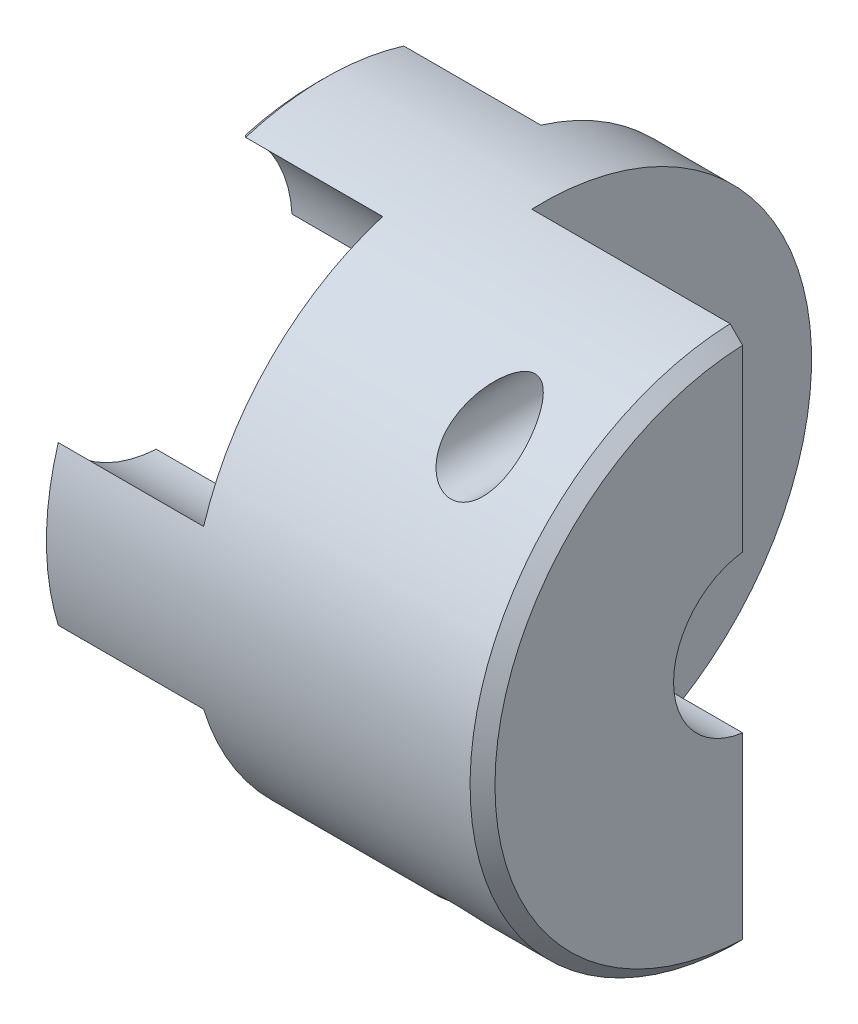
ISO-10303-21;
HEADER;
FILE_DESCRIPTION(('STEP AP214'),'2;1');
FILE_NAME('part.step','',(''),(''),'','','');
FILE_SCHEMA(('AUTOMOTIVE_DESIGN { 1 0 10303 214 1 1 1 1 }'));
ENDSEC;
DATA;
#1=APPLICATION_CONTEXT('core data for automotive mechanical design processes');
#2=APPLICATION_PROTOCOL_DEFINITION('international standard','automotive_design',2000,#1);
#3=PRODUCT_CONTEXT('',#1,'mechanical');
#4=PRODUCT('Part','Part','',(#3));
#5=PRODUCT_RELATED_PRODUCT_CATEGORY('part','',(#4));
#6=PRODUCT_DEFINITION_FORMATION('','',#4);
#7=PRODUCT_DEFINITION_CONTEXT('part definition',#1,'design');
#8=PRODUCT_DEFINITION('design','',#6,#7);
#9=PRODUCT_DEFINITION_SHAPE('','',#8);
#10=(LENGTH_UNIT() NAMED_UNIT(*) SI_UNIT(.MILLI.,.METRE.));
#11=(NAMED_UNIT(*) PLANE_ANGLE_UNIT() SI_UNIT($,.RADIAN.));
#12=(NAMED_UNIT(*) SI_UNIT($,.STERADIAN.) SOLID_ANGLE_UNIT());
#13=UNCERTAINTY_MEASURE_WITH_UNIT(LENGTH_MEASURE(1.E-05),#10,'distance_accuracy_value','');
#14=(GEOMETRIC_REPRESENTATION_CONTEXT(3) GLOBAL_UNCERTAINTY_ASSIGNED_CONTEXT((#13)) GLOBAL_UNIT_ASSIGNED_CONTEXT((#10,
#11,#12)) REPRESENTATION_CONTEXT('',''));
#15=CARTESIAN_POINT('',(0.,0.,0.));
#16=DIRECTION('',(0.,0.,1.));
#17=DIRECTION('',(1.,0.,0.));
#18=AXIS2_PLACEMENT_3D('',#15,#16,#17);
#19=CARTESIAN_POINT('',(0.,0.,0.));
#20=DIRECTION('',(1.,0.,0.));
#21=DIRECTION('',(0.,0.,-1.));
#22=AXIS2_PLACEMENT_3D('',#19,#20,#21);
#23=PLANE('',#22);
#24=CARTESIAN_POINT('',(0.,-18.38477631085,18.38477631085));
#25=DIRECTION('',(-1.,0.,0.));
#26=DIRECTION('',(0.,0.,1.));
#27=AXIS2_PLACEMENT_3D('',#24,#25,#26);
#28=CIRCLE('',#27,15.475);
#29=CARTESIAN_POINT('',(-3.33788033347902E-13,-30.3213313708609,8.53620898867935));
#30=VERTEX_POINT('',#29);
#31=CARTESIAN_POINT('',(0.,-19.2777713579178,2.93556322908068));
#32=VERTEX_POINT('',#31);
#33=EDGE_CURVE('E303',#30,#32,#28,.F.);
#34=ORIENTED_EDGE('',*,*,#33,.T.);
#35=CARTESIAN_POINT('',(0.,0.,0.));
#36=DIRECTION('',(-1.,0.,0.));
#37=DIRECTION('',(0.,0.,1.));
#38=AXIS2_PLACEMENT_3D('',#35,#36,#37);
#39=CIRCLE('',#38,19.5);
#40=CARTESIAN_POINT('',(0.,-19.2777713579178,-2.93556322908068));
#41=VERTEX_POINT('',#40);
#42=EDGE_CURVE('E306',#32,#41,#39,.F.);
#43=ORIENTED_EDGE('',*,*,#42,.T.);
#44=CARTESIAN_POINT('',(0.,-18.38477631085,-18.38477631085));
#45=DIRECTION('',(-1.,0.,0.));
#46=DIRECTION('',(0.,0.,1.));
#47=AXIS2_PLACEMENT_3D('',#44,#45,#46);
#48=CIRCLE('',#47,15.475);
#49=CARTESIAN_POINT('',(-3.33788033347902E-13,-30.3213313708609,-8.53620898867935));
#50=VERTEX_POINT('',#49);
#51=EDGE_CURVE('E278',#41,#50,#48,.F.);
#52=ORIENTED_EDGE('',*,*,#51,.T.);
#53=CARTESIAN_POINT('',(-7.07767178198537E-13,0.,0.));
#54=DIRECTION('',(1.,0.,0.));
#55=DIRECTION('',(0.,0.,-1.));
#56=AXIS2_PLACEMENT_3D('',#53,#54,#55);
#57=CIRCLE('',#56,31.4999999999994);
#58=EDGE_CURVE('E299',#30,#50,#57,.T.);
#59=ORIENTED_EDGE('',*,*,#58,.F.);
#60=EDGE_LOOP('',(#34,#43,#52,#59));
#61=FACE_BOUND('',#60,.T.);
#62=ADVANCED_FACE('F16',(#61),#23,.F.);
#63=CARTESIAN_POINT('',(41.,-25.,1.19062500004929));
#64=DIRECTION('',(0.,0.,-1.));
#65=DIRECTION('',(-1.,0.,0.));
#66=AXIS2_PLACEMENT_3D('',#63,#64,#65);
#67=CONICAL_SURFACE('',#66,4.02499999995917,0.392699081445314);
#68=CARTESIAN_POINT('',(41.,-25.,1.19062499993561));
#69=DIRECTION('',(0.,0.,-1.));
#70=DIRECTION('',(-1.,0.,0.));
#71=AXIS2_PLACEMENT_3D('',#68,#69,#70);
#72=CIRCLE('',#71,4.02500000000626);
#73=CARTESIAN_POINT('',(36.9749999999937,-25.,1.19062499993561));
#74=VERTEX_POINT('',#73);
#75=EDGE_CURVE('E210',#74,#74,#72,.T.);
#76=ORIENTED_EDGE('',*,*,#75,.T.);
#77=EDGE_LOOP('',(#76));
#78=FACE_BOUND('',#77,.T.);
#79=CARTESIAN_POINT('',(41.,-25.,1.250980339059));
#80=DIRECTION('',(0.,0.,-1.));
#81=DIRECTION('',(-1.,0.,0.));
#82=AXIS2_PLACEMENT_3D('',#79,#80,#81);
#83=CIRCLE('',#82,4.);
#84=CARTESIAN_POINT('',(37.,-25.,1.250980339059));
#85=VERTEX_POINT('',#84);
#86=EDGE_CURVE('E212',#85,#85,#83,.F.);
#87=ORIENTED_EDGE('',*,*,#86,.T.);
#88=EDGE_LOOP('',(#87));
#89=FACE_BOUND('',#88,.T.);
#90=ADVANCED_FACE('F780',(#78,#89),#67,.F.);
#91=CARTESIAN_POINT('',(0.,0.,0.));
#92=DIRECTION('',(1.,0.,0.));
#93=DIRECTION('',(0.,0.,-1.));
#94=AXIS2_PLACEMENT_3D('',#91,#92,#93);
#95=PLANE('',#94);
#96=CARTESIAN_POINT('',(0.,0.,0.));
#97=DIRECTION('',(1.,0.,0.));
#98=DIRECTION('',(0.,0.,-1.));
#99=AXIS2_PLACEMENT_3D('',#96,#97,#98);
#100=CIRCLE('',#99,31.5000000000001);
#101=CARTESIAN_POINT('',(-3.42560158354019E-13,-8.53620898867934,-30.3213313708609));
#102=VERTEX_POINT('',#101);
#103=CARTESIAN_POINT('',(0.,8.53620898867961,-30.3213313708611));
#104=VERTEX_POINT('',#103);
#105=EDGE_CURVE('E323',#102,#104,#100,.T.);
#106=ORIENTED_EDGE('',*,*,#105,.F.);
#107=CARTESIAN_POINT('',(0.,-18.38477631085,-18.38477631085));
#108=DIRECTION('',(-1.,0.,0.));
#109=DIRECTION('',(0.,0.,1.));
#110=AXIS2_PLACEMENT_3D('',#107,#108,#109);
#111=CIRCLE('',#110,15.475);
#112=CARTESIAN_POINT('',(0.,-2.93556322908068,-19.2777713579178));
#113=VERTEX_POINT('',#112);
#114=EDGE_CURVE('E269',#102,#113,#111,.F.);
#115=ORIENTED_EDGE('',*,*,#114,.T.);
#116=CARTESIAN_POINT('',(0.,0.,0.));
#117=DIRECTION('',(-1.,0.,0.));
#118=DIRECTION('',(0.,0.,1.));
#119=AXIS2_PLACEMENT_3D('',#116,#117,#118);
#120=CIRCLE('',#119,19.5);
#121=CARTESIAN_POINT('',(0.,2.93556322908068,-19.2777713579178));
#122=VERTEX_POINT('',#121);
#123=EDGE_CURVE('E193',#113,#122,#120,.F.);
#124=ORIENTED_EDGE('',*,*,#123,.T.);
#125=CARTESIAN_POINT('',(0.,18.38477631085,-18.38477631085));
#126=DIRECTION('',(-1.,0.,0.));
#127=DIRECTION('',(0.,0.,1.));
#128=AXIS2_PLACEMENT_3D('',#125,#126,#127);
#129=CIRCLE('',#128,15.475);
#130=EDGE_CURVE('E312',#122,#104,#129,.F.);
#131=ORIENTED_EDGE('',*,*,#130,.T.);
#132=EDGE_LOOP('',(#106,#115,#124,#131));
#133=FACE_BOUND('',#132,.T.);
#134=ADVANCED_FACE('F310',(#133),#95,.F.);
#135=CARTESIAN_POINT('',(0.,0.,0.));
#136=DIRECTION('',(1.,0.,0.));
#137=DIRECTION('',(0.,0.,-1.));
#138=AXIS2_PLACEMENT_3D('',#135,#136,#137);
#139=PLANE('',#138);
#140=CARTESIAN_POINT('',(0.,18.38477631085,-18.38477631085));
#141=DIRECTION('',(-1.,0.,0.));
#142=DIRECTION('',(0.,0.,1.));
#143=AXIS2_PLACEMENT_3D('',#140,#141,#142);
#144=CIRCLE('',#143,15.475);
#145=CARTESIAN_POINT('',(-3.33788033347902E-13,30.3213313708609,-8.53620898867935));
#146=VERTEX_POINT('',#145);
#147=CARTESIAN_POINT('',(0.,19.2777713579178,-2.93556322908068));
#148=VERTEX_POINT('',#147);
#149=EDGE_CURVE('E175',#146,#148,#144,.F.);
#150=ORIENTED_EDGE('',*,*,#149,.T.);
#151=CARTESIAN_POINT('',(0.,0.,0.));
#152=DIRECTION('',(-1.,0.,0.));
#153=DIRECTION('',(0.,0.,1.));
#154=AXIS2_PLACEMENT_3D('',#151,#152,#153);
#155=CIRCLE('',#154,19.5);
#156=CARTESIAN_POINT('',(0.,19.2777713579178,2.93556322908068));
#157=VERTEX_POINT('',#156);
#158=EDGE_CURVE('E19',#148,#157,#155,.F.);
#159=ORIENTED_EDGE('',*,*,#158,.T.);
#160=CARTESIAN_POINT('',(0.,18.38477631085,18.38477631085));
#161=DIRECTION('',(-1.,0.,0.));
#162=DIRECTION('',(0.,0.,1.));
#163=AXIS2_PLACEMENT_3D('',#160,#161,#162);
#164=CIRCLE('',#163,15.475);
#165=CARTESIAN_POINT('',(-3.33788033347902E-13,30.3213313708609,8.53620898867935));
#166=VERTEX_POINT('',#165);
#167=EDGE_CURVE('E206',#157,#166,#164,.F.);
#168=ORIENTED_EDGE('',*,*,#167,.T.);
#169=CARTESIAN_POINT('',(-7.07767178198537E-13,0.,0.));
#170=DIRECTION('',(1.,0.,0.));
#171=DIRECTION('',(0.,0.,-1.));
#172=AXIS2_PLACEMENT_3D('',#169,#170,#171);
#173=CIRCLE('',#172,31.4999999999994);
#174=EDGE_CURVE('E180',#146,#166,#173,.T.);
#175=ORIENTED_EDGE('',*,*,#174,.F.);
#176=EDGE_LOOP('',(#150,#159,#168,#175));
#177=FACE_BOUND('',#176,.T.);
#178=ADVANCED_FACE('F177',(#177),#139,.F.);
#179=CARTESIAN_POINT('',(17.5,0.,0.));
#180=DIRECTION('',(-1.,0.,0.));
#181=DIRECTION('',(0.,0.,1.));
#182=AXIS2_PLACEMENT_3D('',#179,#180,#181);
#183=CYLINDRICAL_SURFACE('',#182,19.5);
#184=ORIENTED_EDGE('',*,*,#158,.F.);
#185=DIRECTION('',(-1.,0.,0.));
#186=VECTOR('',#185,1.);
#187=CARTESIAN_POINT('',(17.5,19.27777135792,-2.93556322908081));
#188=LINE('',#187,#186);
#189=CARTESIAN_POINT('',(17.5,19.2777713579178,-2.93556322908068));
#190=VERTEX_POINT('',#189);
#191=EDGE_CURVE('E184',#148,#190,#188,.F.);
#192=ORIENTED_EDGE('',*,*,#191,.T.);
#193=CARTESIAN_POINT('',(17.5,0.,0.));
#194=DIRECTION('',(-1.,0.,0.));
#195=DIRECTION('',(0.,0.,1.));
#196=AXIS2_PLACEMENT_3D('',#193,#194,#195);
#197=CIRCLE('',#196,19.5);
#198=CARTESIAN_POINT('',(17.5,19.2777713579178,2.93556322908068));
#199=VERTEX_POINT('',#198);
#200=EDGE_CURVE('E422',#199,#190,#197,.T.);
#201=ORIENTED_EDGE('',*,*,#200,.F.);
#202=DIRECTION('',(-1.,0.,0.));
#203=VECTOR('',#202,1.);
#204=CARTESIAN_POINT('',(17.5,19.27777135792,2.93556322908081));
#205=LINE('',#204,#203);
#206=EDGE_CURVE('E191',#199,#157,#205,.T.);
#207=ORIENTED_EDGE('',*,*,#206,.T.);
#208=EDGE_LOOP('',(#184,#192,#201,#207));
#209=FACE_BOUND('',#208,.T.);
#210=ADVANCED_FACE('F188',(#209),#183,.F.);
#211=CARTESIAN_POINT('',(17.5,0.,0.));
#212=DIRECTION('',(-1.,0.,0.));
#213=DIRECTION('',(0.,0.,1.));
#214=AXIS2_PLACEMENT_3D('',#211,#212,#213);
#215=CYLINDRICAL_SURFACE('',#214,19.5);
#216=DIRECTION('',(-1.,0.,0.));
#217=VECTOR('',#216,1.);
#218=CARTESIAN_POINT('',(17.5,-2.93556322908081,-19.27777135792));
#219=LINE('',#218,#217);
#220=CARTESIAN_POINT('',(17.5,-2.93556322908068,-19.2777713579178));
#221=VERTEX_POINT('',#220);
#222=EDGE_CURVE('E267',#113,#221,#219,.F.);
#223=ORIENTED_EDGE('',*,*,#222,.T.);
#224=CARTESIAN_POINT('',(17.5,0.,0.));
#225=DIRECTION('',(-1.,0.,0.));
#226=DIRECTION('',(0.,0.,1.));
#227=AXIS2_PLACEMENT_3D('',#224,#225,#226);
#228=CIRCLE('',#227,19.5);
#229=CARTESIAN_POINT('',(17.5,2.93556322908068,-19.2777713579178));
#230=VERTEX_POINT('',#229);
#231=EDGE_CURVE('E320',#230,#221,#228,.T.);
#232=ORIENTED_EDGE('',*,*,#231,.F.);
#233=DIRECTION('',(-1.,0.,0.));
#234=VECTOR('',#233,1.);
#235=CARTESIAN_POINT('',(17.5,2.93556322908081,-19.27777135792));
#236=LINE('',#235,#234);
#237=EDGE_CURVE('E203',#230,#122,#236,.T.);
#238=ORIENTED_EDGE('',*,*,#237,.T.);
#239=ORIENTED_EDGE('',*,*,#123,.F.);
#240=EDGE_LOOP('',(#223,#232,#238,#239));
#241=FACE_BOUND('',#240,.T.);
#242=ADVANCED_FACE('F318',(#241),#215,.F.);
#243=CARTESIAN_POINT('',(17.5,0.,0.));
#244=DIRECTION('',(-1.,0.,0.));
#245=DIRECTION('',(0.,0.,1.));
#246=AXIS2_PLACEMENT_3D('',#243,#244,#245);
#247=CYLINDRICAL_SURFACE('',#246,19.5);
#248=CARTESIAN_POINT('',(17.5,0.,0.));
#249=DIRECTION('',(-1.,0.,0.));
#250=DIRECTION('',(0.,0.,1.));
#251=AXIS2_PLACEMENT_3D('',#248,#249,#250);
#252=CIRCLE('',#251,19.5);
#253=CARTESIAN_POINT('',(17.5,-19.2777713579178,-2.93556322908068));
#254=VERTEX_POINT('',#253);
#255=CARTESIAN_POINT('',(17.5,-19.2777713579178,2.93556322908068));
#256=VERTEX_POINT('',#255);
#257=EDGE_CURVE('E513',#254,#256,#252,.T.);
#258=ORIENTED_EDGE('',*,*,#257,.F.);
#259=DIRECTION('',(-1.,0.,0.));
#260=VECTOR('',#259,1.);
#261=CARTESIAN_POINT('',(17.5,-19.27777135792,-2.93556322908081));
#262=LINE('',#261,#260);
#263=EDGE_CURVE('E298',#254,#41,#262,.T.);
#264=ORIENTED_EDGE('',*,*,#263,.T.);
#265=ORIENTED_EDGE('',*,*,#42,.F.);
#266=DIRECTION('',(-1.,0.,0.));
#267=VECTOR('',#266,1.);
#268=CARTESIAN_POINT('',(17.5,-19.27777135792,2.93556322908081));
#269=LINE('',#268,#267);
#270=EDGE_CURVE('E302',#32,#256,#269,.F.);
#271=ORIENTED_EDGE('',*,*,#270,.T.);
#272=EDGE_LOOP('',(#258,#264,#265,#271));
#273=FACE_BOUND('',#272,.T.);
#274=ADVANCED_FACE('F523',(#273),#247,.F.);
#275=CARTESIAN_POINT('',(17.5,0.,0.));
#276=DIRECTION('',(-1.,0.,0.));
#277=DIRECTION('',(0.,0.,1.));
#278=AXIS2_PLACEMENT_3D('',#275,#276,#277);
#279=CYLINDRICAL_SURFACE('',#278,19.5);
#280=CARTESIAN_POINT('',(0.,0.,0.));
#281=DIRECTION('',(-1.,0.,0.));
#282=DIRECTION('',(0.,0.,1.));
#283=AXIS2_PLACEMENT_3D('',#280,#281,#282);
#284=CIRCLE('',#283,19.5);
#285=CARTESIAN_POINT('',(0.,-2.93556322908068,19.2777713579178));
#286=VERTEX_POINT('',#285);
#287=CARTESIAN_POINT('',(0.,2.93556322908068,19.2777713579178));
#288=VERTEX_POINT('',#287);
#289=EDGE_CURVE('E578',#286,#288,#284,.T.);
#290=ORIENTED_EDGE('',*,*,#289,.T.);
#291=DIRECTION('',(-1.,0.,0.));
#292=VECTOR('',#291,1.);
#293=CARTESIAN_POINT('',(17.5,2.93556322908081,19.27777135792));
#294=LINE('',#293,#292);
#295=CARTESIAN_POINT('',(17.5,2.93556322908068,19.2777713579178));
#296=VERTEX_POINT('',#295);
#297=EDGE_CURVE('E394',#288,#296,#294,.F.);
#298=ORIENTED_EDGE('',*,*,#297,.T.);
#299=CARTESIAN_POINT('',(17.5,0.,0.));
#300=DIRECTION('',(-1.,0.,0.));
#301=DIRECTION('',(0.,0.,1.));
#302=AXIS2_PLACEMENT_3D('',#299,#300,#301);
#303=CIRCLE('',#302,19.5);
#304=CARTESIAN_POINT('',(17.5,-2.93556322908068,19.2777713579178));
#305=VERTEX_POINT('',#304);
#306=EDGE_CURVE('E503',#305,#296,#303,.T.);
#307=ORIENTED_EDGE('',*,*,#306,.F.);
#308=DIRECTION('',(-1.,0.,0.));
#309=VECTOR('',#308,1.);
#310=CARTESIAN_POINT('',(17.5,-2.93556322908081,19.27777135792));
#311=LINE('',#310,#309);
#312=EDGE_CURVE('E305',#305,#286,#311,.T.);
#313=ORIENTED_EDGE('',*,*,#312,.T.);
#314=EDGE_LOOP('',(#290,#298,#307,#313));
#315=FACE_BOUND('',#314,.T.);
#316=ADVANCED_FACE('F542',(#315),#279,.F.);
#317=CARTESIAN_POINT('',(17.5,-18.38477631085,18.38477631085));
#318=DIRECTION('',(-1.,0.,0.));
#319=DIRECTION('',(0.,0.,1.));
#320=AXIS2_PLACEMENT_3D('',#317,#318,#319);
#321=CYLINDRICAL_SURFACE('',#320,15.475);
#322=CARTESIAN_POINT('',(0.,-18.38477631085,18.38477631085));
#323=DIRECTION('',(-1.,0.,0.));
#324=DIRECTION('',(0.,0.,1.));
#325=AXIS2_PLACEMENT_3D('',#322,#323,#324);
#326=CIRCLE('',#325,15.475);
#327=CARTESIAN_POINT('',(0.,-9.52532128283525,31.0727896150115));
#328=VERTEX_POINT('',#327);
#329=EDGE_CURVE('E539',#328,#286,#326,.T.);
#330=ORIENTED_EDGE('',*,*,#329,.T.);
#331=ORIENTED_EDGE('',*,*,#312,.F.);
#332=CARTESIAN_POINT('',(17.5,-18.38477631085,18.38477631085));
#333=DIRECTION('',(-1.,0.,0.));
#334=DIRECTION('',(0.,0.,1.));
#335=AXIS2_PLACEMENT_3D('',#332,#333,#334);
#336=CIRCLE('',#335,15.475);
#337=CARTESIAN_POINT('',(17.5,-9.52532128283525,31.0727896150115));
#338=VERTEX_POINT('',#337);
#339=EDGE_CURVE('E505',#338,#305,#336,.T.);
#340=ORIENTED_EDGE('',*,*,#339,.F.);
#341=DIRECTION('',(-1.,0.,0.));
#342=VECTOR('',#341,1.);
#343=CARTESIAN_POINT('',(52.5,-9.52532128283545,31.0727896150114));
#344=LINE('',#343,#342);
#345=EDGE_CURVE('E391',#328,#338,#344,.F.);
#346=ORIENTED_EDGE('',*,*,#345,.F.);
#347=EDGE_LOOP('',(#330,#331,#340,#346));
#348=FACE_BOUND('',#347,.T.);
#349=ADVANCED_FACE('F538',(#348),#321,.F.);
#350=CARTESIAN_POINT('',(17.5,-18.38477631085,18.38477631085));
#351=DIRECTION('',(-1.,0.,0.));
#352=DIRECTION('',(0.,0.,1.));
#353=AXIS2_PLACEMENT_3D('',#350,#351,#352);
#354=CYLINDRICAL_SURFACE('',#353,15.475);
#355=DIRECTION('',(-1.,0.,0.));
#356=VECTOR('',#355,1.);
#357=CARTESIAN_POINT('',(52.5,-31.0727896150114,9.52532128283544));
#358=LINE('',#357,#356);
#359=CARTESIAN_POINT('',(17.5,-31.0727896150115,9.52532128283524));
#360=VERTEX_POINT('',#359);
#361=CARTESIAN_POINT('',(0.999999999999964,-31.0727896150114,9.52532128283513));
#362=VERTEX_POINT('',#361);
#363=EDGE_CURVE('E387',#360,#362,#358,.T.);
#364=ORIENTED_EDGE('',*,*,#363,.F.);
#365=CARTESIAN_POINT('',(17.5,-18.38477631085,18.38477631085));
#366=DIRECTION('',(-1.,0.,0.));
#367=DIRECTION('',(0.,0.,1.));
#368=AXIS2_PLACEMENT_3D('',#365,#366,#367);
#369=CIRCLE('',#368,15.475);
#370=EDGE_CURVE('E511',#256,#360,#369,.T.);
#371=ORIENTED_EDGE('',*,*,#370,.F.);
#372=ORIENTED_EDGE('',*,*,#270,.F.);
#373=ORIENTED_EDGE('',*,*,#33,.F.);
#374=CARTESIAN_POINT('',(0.999999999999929,-31.0727896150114,9.52532128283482));
#375=CARTESIAN_POINT('',(0.917745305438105,-31.0130039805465,9.43969965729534));
#376=CARTESIAN_POINT('',(0.835206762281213,-30.952479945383,9.35486693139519));
#377=CARTESIAN_POINT('',(0.669601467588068,-30.8300125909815,9.18681316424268));
#378=CARTESIAN_POINT('',(0.58653486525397,-30.7680696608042,9.103591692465));
#379=CARTESIAN_POINT('',(0.419868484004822,-30.6427896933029,8.93874804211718));
#380=CARTESIAN_POINT('',(0.336268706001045,-30.5794526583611,8.85712586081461));
#381=CARTESIAN_POINT('',(0.168529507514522,-30.4514069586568,8.69546854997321));
#382=CARTESIAN_POINT('',(0.0843899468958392,-30.3866979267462,8.615433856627));
#383=CARTESIAN_POINT('',(-4.61869547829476E-13,-30.3213313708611,8.53620898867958));
#384=B_SPLINE_CURVE_WITH_KNOTS('',3,(#374,#375,#376,#377,#378,#379,#380,#381,#382,#383),
.UNSPECIFIED.,.F.,.F.,(4,2,2,2,4),(0.,0.398794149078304,0.797480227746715,1.19616562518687,
1.59495909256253),.UNSPECIFIED.);
#385=EDGE_CURVE('E291',#362,#30,#384,.T.);
#386=ORIENTED_EDGE('',*,*,#385,.F.);
#387=EDGE_LOOP('',(#364,#371,#372,#373,#386));
#388=FACE_BOUND('',#387,.T.);
#389=ADVANCED_FACE('F286',(#388),#354,.F.);
#390=CARTESIAN_POINT('',(0.999999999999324,0.,0.));
#391=DIRECTION('',(1.,0.,0.));
#392=DIRECTION('',(0.,0.,-1.));
#393=AXIS2_PLACEMENT_3D('',#390,#391,#392);
#394=CONICAL_SURFACE('',#393,32.4999999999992,0.785398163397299);
#395=CARTESIAN_POINT('',(1.,0.,0.));
#396=DIRECTION('',(-1.,0.,0.));
#397=DIRECTION('',(0.,0.,1.));
#398=AXIS2_PLACEMENT_3D('',#395,#396,#397);
#399=CIRCLE('',#398,32.5);
#400=CARTESIAN_POINT('',(0.999999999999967,-31.0727896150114,-9.52532128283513));
#401=VERTEX_POINT('',#400);
#402=EDGE_CURVE('E384',#362,#401,#399,.F.);
#403=ORIENTED_EDGE('',*,*,#402,.F.);
#404=ORIENTED_EDGE('',*,*,#385,.T.);
#405=ORIENTED_EDGE('',*,*,#58,.T.);
#406=CARTESIAN_POINT('',(-4.63286763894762E-13,-30.3213313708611,-8.53620898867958));
#407=CARTESIAN_POINT('',(0.0843899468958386,-30.3866979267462,-8.615433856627));
#408=CARTESIAN_POINT('',(0.168529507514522,-30.4514069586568,-8.69546854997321));
#409=CARTESIAN_POINT('',(0.336268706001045,-30.5794526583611,-8.85712586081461));
#410=CARTESIAN_POINT('',(0.419868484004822,-30.6427896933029,-8.93874804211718));
#411=CARTESIAN_POINT('',(0.58653486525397,-30.7680696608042,-9.103591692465));
#412=CARTESIAN_POINT('',(0.669601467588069,-30.8300125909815,-9.18681316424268));
#413=CARTESIAN_POINT('',(0.835206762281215,-30.952479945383,-9.35486693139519));
#414=CARTESIAN_POINT('',(0.917745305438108,-31.0130039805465,-9.43969965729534));
#415=CARTESIAN_POINT('',(0.999999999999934,-31.0727896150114,-9.52532128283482));
#416=B_SPLINE_CURVE_WITH_KNOTS('',3,(#406,#407,#408,#409,#410,#411,#412,#413,#414,#415),
.UNSPECIFIED.,.F.,.F.,(4,2,2,2,4),(0.,0.398793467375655,0.797478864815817,1.19616494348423,
1.59495909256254),.UNSPECIFIED.);
#417=EDGE_CURVE('E271',#50,#401,#416,.T.);
#418=ORIENTED_EDGE('',*,*,#417,.T.);
#419=EDGE_LOOP('',(#403,#404,#405,#418));
#420=FACE_BOUND('',#419,.T.);
#421=ADVANCED_FACE('F282',(#420),#394,.T.);
#422=CARTESIAN_POINT('',(17.5,-18.38477631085,-18.38477631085));
#423=DIRECTION('',(-1.,0.,0.));
#424=DIRECTION('',(0.,0.,1.));
#425=AXIS2_PLACEMENT_3D('',#422,#423,#424);
#426=CYLINDRICAL_SURFACE('',#425,15.475);
#427=ORIENTED_EDGE('',*,*,#51,.F.);
#428=ORIENTED_EDGE('',*,*,#263,.F.);
#429=CARTESIAN_POINT('',(17.5,-18.38477631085,-18.38477631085));
#430=DIRECTION('',(-1.,0.,0.));
#431=DIRECTION('',(0.,0.,1.));
#432=AXIS2_PLACEMENT_3D('',#429,#430,#431);
#433=CIRCLE('',#432,15.475);
#434=CARTESIAN_POINT('',(17.5,-31.0727896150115,-9.52532128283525));
#435=VERTEX_POINT('',#434);
#436=EDGE_CURVE('E411',#435,#254,#433,.T.);
#437=ORIENTED_EDGE('',*,*,#436,.F.);
#438=DIRECTION('',(-1.,0.,0.));
#439=VECTOR('',#438,1.);
#440=CARTESIAN_POINT('',(52.5,-31.0727896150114,-9.52532128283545));
#441=LINE('',#440,#439);
#442=EDGE_CURVE('E381',#401,#435,#441,.F.);
#443=ORIENTED_EDGE('',*,*,#442,.F.);
#444=ORIENTED_EDGE('',*,*,#417,.F.);
#445=EDGE_LOOP('',(#427,#428,#437,#443,#444));
#446=FACE_BOUND('',#445,.T.);
#447=ADVANCED_FACE('F280',(#446),#426,.F.);
#448=CARTESIAN_POINT('',(17.5,-18.38477631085,-18.38477631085));
#449=DIRECTION('',(-1.,0.,0.));
#450=DIRECTION('',(0.,0.,1.));
#451=AXIS2_PLACEMENT_3D('',#448,#449,#450);
#452=CYLINDRICAL_SURFACE('',#451,15.475);
#453=DIRECTION('',(-1.,0.,0.));
#454=VECTOR('',#453,1.);
#455=CARTESIAN_POINT('',(52.5,-9.52532128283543,-31.0727896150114));
#456=LINE('',#455,#454);
#457=CARTESIAN_POINT('',(17.5,-9.52532128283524,-31.0727896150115));
#458=VERTEX_POINT('',#457);
#459=CARTESIAN_POINT('',(0.999999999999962,-9.52532128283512,-31.0727896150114));
#460=VERTEX_POINT('',#459);
#461=EDGE_CURVE('E241',#458,#460,#456,.T.);
#462=ORIENTED_EDGE('',*,*,#461,.F.);
#463=CARTESIAN_POINT('',(17.5,-18.38477631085,-18.38477631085));
#464=DIRECTION('',(-1.,0.,0.));
#465=DIRECTION('',(0.,0.,1.));
#466=AXIS2_PLACEMENT_3D('',#463,#464,#465);
#467=CIRCLE('',#466,15.475);
#468=EDGE_CURVE('E406',#221,#458,#467,.T.);
#469=ORIENTED_EDGE('',*,*,#468,.F.);
#470=ORIENTED_EDGE('',*,*,#222,.F.);
#471=ORIENTED_EDGE('',*,*,#114,.F.);
#472=CARTESIAN_POINT('',(0.999999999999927,-9.52532128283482,-31.0727896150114));
#473=CARTESIAN_POINT('',(0.917745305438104,-9.43969965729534,-31.0130039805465));
#474=CARTESIAN_POINT('',(0.835206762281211,-9.35486693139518,-30.952479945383));
#475=CARTESIAN_POINT('',(0.669601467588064,-9.18681316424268,-30.8300125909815));
#476=CARTESIAN_POINT('',(0.586534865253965,-9.103591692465,-30.7680696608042));
#477=CARTESIAN_POINT('',(0.419868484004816,-8.93874804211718,-30.6427896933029));
#478=CARTESIAN_POINT('',(0.33626870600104,-8.85712586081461,-30.5794526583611));
#479=CARTESIAN_POINT('',(0.168529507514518,-8.69546854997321,-30.4514069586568));
#480=CARTESIAN_POINT('',(0.0843899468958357,-8.61543385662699,-30.3866979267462));
#481=CARTESIAN_POINT('',(-4.65466974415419E-13,-8.53620898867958,-30.3213313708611));
#482=B_SPLINE_CURVE_WITH_KNOTS('',3,(#472,#473,#474,#475,#476,#477,#478,#479,#480,#481),
.UNSPECIFIED.,.F.,.F.,(4,2,2,2,4),(0.,0.398794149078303,0.797480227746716,1.19616562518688,
1.59495909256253),.UNSPECIFIED.);
#483=EDGE_CURVE('E215',#460,#102,#482,.T.);
#484=ORIENTED_EDGE('',*,*,#483,.F.);
#485=EDGE_LOOP('',(#462,#469,#470,#471,#484));
#486=FACE_BOUND('',#485,.T.);
#487=ADVANCED_FACE('F251',(#486),#452,.F.);
#488=CARTESIAN_POINT('',(41.,-25.,1.190625));
#489=DIRECTION('',(0.,0.,-1.));
#490=DIRECTION('',(-1.,0.,0.));
#491=AXIS2_PLACEMENT_3D('',#488,#489,#490);
#492=CYLINDRICAL_SURFACE('',#491,4.);
#493=ORIENTED_EDGE('',*,*,#86,.F.);
#494=EDGE_LOOP('',(#493));
#495=FACE_BOUND('',#494,.T.);
#496=CARTESIAN_POINT('',(37.,-24.9999999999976,20.766559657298));
#497=CARTESIAN_POINT('',(37.0000024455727,-24.8509131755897,20.9460409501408));
#498=CARTESIAN_POINT('',(37.0083227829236,-24.6998961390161,21.1239036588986));
#499=CARTESIAN_POINT('',(37.043052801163,-24.3949133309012,21.4753883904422));
#500=CARTESIAN_POINT('',(37.0694642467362,-24.240947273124,21.6490099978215));
#501=CARTESIAN_POINT('',(37.1419843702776,-23.9319053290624,21.9901498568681));
#502=CARTESIAN_POINT('',(37.1880313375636,-23.7768344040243,22.1576854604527));
#503=CARTESIAN_POINT('',(37.3017112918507,-23.4670752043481,22.4854887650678));
#504=CARTESIAN_POINT('',(37.3693292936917,-23.3123867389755,22.6457614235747));
#505=CARTESIAN_POINT('',(37.5428259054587,-22.9776995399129,22.9856911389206));
#506=CARTESIAN_POINT('',(37.6534413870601,-22.7982485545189,23.1635292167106));
#507=CARTESIAN_POINT('',(37.9111646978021,-22.4493094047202,23.5018594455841));
#508=CARTESIAN_POINT('',(38.0582355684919,-22.2798113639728,23.6623689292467));
#509=CARTESIAN_POINT('',(38.3601582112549,-21.9889134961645,23.9326053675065));
#510=CARTESIAN_POINT('',(38.5085041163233,-21.8644243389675,24.0462290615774));
#511=CARTESIAN_POINT('',(38.8306712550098,-21.6335210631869,24.2541720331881));
#512=CARTESIAN_POINT('',(39.0044630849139,-21.5270863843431,24.3485132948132));
#513=CARTESIAN_POINT('',(39.3448302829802,-21.354379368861,24.500030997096));
#514=CARTESIAN_POINT('',(39.5078954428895,-21.2843810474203,24.5607674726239));
#515=CARTESIAN_POINT('',(39.7622353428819,-21.1952596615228,24.6376236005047));
#516=CARTESIAN_POINT('',(39.8486708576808,-21.1681918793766,24.6608731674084));
#517=CARTESIAN_POINT('',(40.0242843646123,-21.1197603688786,24.7023630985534));
#518=CARTESIAN_POINT('',(40.1134612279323,-21.0983943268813,24.7206054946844));
#519=CARTESIAN_POINT('',(40.2944044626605,-21.0616370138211,24.7519298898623));
#520=CARTESIAN_POINT('',(40.3861815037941,-21.0462759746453,24.7649857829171));
#521=CARTESIAN_POINT('',(40.5711530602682,-21.021962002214,24.7856282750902));
#522=CARTESIAN_POINT('',(40.6643469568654,-21.0130063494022,24.7932171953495));
#523=CARTESIAN_POINT('',(40.8514237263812,-21.0016619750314,24.8028274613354));
#524=CARTESIAN_POINT('',(40.9453066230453,-20.9992734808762,24.8048486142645));
#525=CARTESIAN_POINT('',(41.1329564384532,-21.0011093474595,24.8032942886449));
#526=CARTESIAN_POINT('',(41.2267233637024,-21.0053333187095,24.7997191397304));
#527=CARTESIAN_POINT('',(41.4060815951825,-21.0197302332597,24.7875174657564));
#528=CARTESIAN_POINT('',(41.4917408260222,-21.0294141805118,24.7793060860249));
#529=CARTESIAN_POINT('',(41.661711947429,-21.0541758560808,24.7582700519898));
#530=CARTESIAN_POINT('',(41.7460233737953,-21.0692554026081,24.7454438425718));
#531=CARTESIAN_POINT('',(41.9960164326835,-21.122258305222,24.7002512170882));
#532=CARTESIAN_POINT('',(42.1589370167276,-21.1679609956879,24.6611582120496));
#533=CARTESIAN_POINT('',(42.4779704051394,-21.2791093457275,24.5653206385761));
#534=CARTESIAN_POINT('',(42.6337465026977,-21.3450914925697,24.5080949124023));
#535=CARTESIAN_POINT('',(42.9307795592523,-21.4929147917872,24.378561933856));
#536=CARTESIAN_POINT('',(43.0720295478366,-21.574763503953,24.3062474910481));
#537=CARTESIAN_POINT('',(43.3923114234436,-21.7864276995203,24.1169831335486));
#538=CARTESIAN_POINT('',(43.5636634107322,-21.9222889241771,23.9937835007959));
#539=CARTESIAN_POINT('',(43.8744417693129,-22.2102573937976,23.7274733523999));
#540=CARTESIAN_POINT('',(44.0138022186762,-22.3623972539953,23.5843226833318));
#541=CARTESIAN_POINT('',(44.2221077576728,-22.6258656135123,23.3311428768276));
#542=CARTESIAN_POINT('',(44.2993235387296,-22.7346996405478,23.2251476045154));
#543=CARTESIAN_POINT('',(44.4403118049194,-22.95515936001,23.0072737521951));
#544=CARTESIAN_POINT('',(44.5040832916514,-23.0667852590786,22.8953947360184));
#545=CARTESIAN_POINT('',(44.6190065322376,-23.2915679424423,22.6666847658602));
#546=CARTESIAN_POINT('',(44.6701497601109,-23.4047257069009,22.5498505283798));
#547=CARTESIAN_POINT('',(44.7605777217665,-23.6314441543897,22.3121459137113));
#548=CARTESIAN_POINT('',(44.7998641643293,-23.7450047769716,22.1912761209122));
#549=CARTESIAN_POINT('',(44.8912075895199,-24.0517257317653,21.8596746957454));
#550=CARTESIAN_POINT('',(44.9327342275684,-24.2445477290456,21.6456794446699));
#551=CARTESIAN_POINT('',(44.9871239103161,-24.6259182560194,21.2107967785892));
#552=CARTESIAN_POINT('',(45.0000011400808,-24.8144688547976,20.9899128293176));
#553=CARTESIAN_POINT('',(44.9999988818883,-25.1819560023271,20.5475104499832));
#554=CARTESIAN_POINT('',(44.9876109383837,-25.3610077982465,20.3260862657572));
#555=CARTESIAN_POINT('',(44.9400816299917,-25.7121606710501,19.8800259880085));
#556=CARTESIAN_POINT('',(44.9049264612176,-25.884257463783,19.6553880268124));
#557=CARTESIAN_POINT('',(44.813092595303,-26.2210173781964,19.2038494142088));
#558=CARTESIAN_POINT('',(44.7563467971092,-26.3856555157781,18.976943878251));
#559=CARTESIAN_POINT('',(44.6220534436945,-26.7061416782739,18.5232037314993));
#560=CARTESIAN_POINT('',(44.5445144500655,-26.8619932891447,18.296369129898));
#561=CARTESIAN_POINT('',(44.3906430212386,-27.126181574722,17.9014433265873));
#562=CARTESIAN_POINT('',(44.3189197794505,-27.2366036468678,17.73293786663));
#563=CARTESIAN_POINT('',(44.1632882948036,-27.4517839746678,17.3979639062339));
#564=CARTESIAN_POINT('',(44.0793824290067,-27.5565433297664,17.2314950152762));
#565=CARTESIAN_POINT('',(43.8988907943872,-27.7594936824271,16.9025942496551));
#566=CARTESIAN_POINT('',(43.8023598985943,-27.8577104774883,16.7401483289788));
#567=CARTESIAN_POINT('',(43.5949705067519,-28.0472725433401,16.4205644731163));
#568=CARTESIAN_POINT('',(43.4841225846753,-28.1386228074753,16.2634227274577));
#569=CARTESIAN_POINT('',(43.2597725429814,-28.3030971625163,15.9752599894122));
#570=CARTESIAN_POINT('',(43.1480930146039,-28.3771038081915,15.843331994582));
#571=CARTESIAN_POINT('',(42.9092139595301,-28.517695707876,15.5888455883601));
#572=CARTESIAN_POINT('',(42.781976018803,-28.5842617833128,15.4663116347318));
#573=CARTESIAN_POINT('',(42.5766323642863,-28.6769504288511,15.2933626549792));
#574=CARTESIAN_POINT('',(42.5051371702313,-28.7068632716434,15.2371158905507));
#575=CARTESIAN_POINT('',(42.3571211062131,-28.7635769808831,15.1297821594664));
#576=CARTESIAN_POINT('',(42.2805987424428,-28.7903769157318,15.0786967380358));
#577=CARTESIAN_POINT('',(42.1226971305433,-28.8400994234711,14.9833756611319));
#578=CARTESIAN_POINT('',(42.0413430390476,-28.8630400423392,14.939108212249));
#579=CARTESIAN_POINT('',(41.8735864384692,-28.9043948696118,14.8589364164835));
#580=CARTESIAN_POINT('',(41.7871899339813,-28.9228143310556,14.8230223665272));
#581=CARTESIAN_POINT('',(41.5991223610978,-28.9561608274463,14.7577865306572));
#582=CARTESIAN_POINT('',(41.4968615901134,-28.9704047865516,14.7297705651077));
#583=CARTESIAN_POINT('',(41.2885518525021,-28.99094722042,14.6892993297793));
#584=CARTESIAN_POINT('',(41.182506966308,-28.99725400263,14.6768277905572));
#585=CARTESIAN_POINT('',(40.9692748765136,-29.001306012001,14.6688198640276));
#586=CARTESIAN_POINT('',(40.8620852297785,-28.999025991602,14.6733334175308));
#587=CARTESIAN_POINT('',(40.6501985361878,-28.9860934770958,14.6988629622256));
#588=CARTESIAN_POINT('',(40.5455037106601,-28.975433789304,14.7198931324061));
#589=CARTESIAN_POINT('',(40.3163368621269,-28.9432292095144,14.7831326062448));
#590=CARTESIAN_POINT('',(40.193245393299,-28.9196678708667,14.8292481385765));
#591=CARTESIAN_POINT('',(39.9569291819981,-28.8635285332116,14.9382209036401));
#592=CARTESIAN_POINT('',(39.8437263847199,-28.8309311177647,15.0011141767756));
#593=CARTESIAN_POINT('',(39.6477152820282,-28.7656204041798,15.1259078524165));
#594=CARTESIAN_POINT('',(39.5631879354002,-28.7340749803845,15.1857830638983));
#595=CARTESIAN_POINT('',(39.4002825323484,-28.6672416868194,15.3115749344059));
#596=CARTESIAN_POINT('',(39.3219086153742,-28.6319513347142,15.3774955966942));
#597=CARTESIAN_POINT('',(39.1707132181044,-28.5582015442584,15.5140309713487));
#598=CARTESIAN_POINT('',(39.0979020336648,-28.5197364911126,15.5846539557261));
#599=CARTESIAN_POINT('',(38.957445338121,-28.4401281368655,15.7294614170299));
#600=CARTESIAN_POINT('',(38.8898018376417,-28.3989838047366,15.8036472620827));
#601=CARTESIAN_POINT('',(38.6997494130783,-28.275820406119,16.0235848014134));
#602=CARTESIAN_POINT('',(38.5835601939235,-28.1906971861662,16.1729903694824));
#603=CARTESIAN_POINT('',(38.3657895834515,-28.0134088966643,16.4781728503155));
#604=CARTESIAN_POINT('',(38.2642207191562,-27.9212378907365,16.6339550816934));
#605=CARTESIAN_POINT('',(38.0738750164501,-27.7305618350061,16.9499277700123));
#606=CARTESIAN_POINT('',(37.9851248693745,-27.6320441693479,17.1101266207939));
#607=CARTESIAN_POINT('',(37.8195717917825,-27.4293999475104,17.4331414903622));
#608=CARTESIAN_POINT('',(37.7427719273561,-27.3252719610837,17.5959581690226));
#609=CARTESIAN_POINT('',(37.5627616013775,-27.0552272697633,18.0098269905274));
#610=CARTESIAN_POINT('',(37.46712061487,-26.8858068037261,18.2619179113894));
#611=CARTESIAN_POINT('',(37.3015015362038,-26.5357680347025,18.766926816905));
#612=CARTESIAN_POINT('',(37.23153880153,-26.3551431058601,19.0198452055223));
#613=CARTESIAN_POINT('',(37.1180129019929,-25.9837970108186,19.524095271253));
#614=CARTESIAN_POINT('',(37.0744412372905,-25.7930791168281,19.7754274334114));
#615=CARTESIAN_POINT('',(37.0154414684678,-25.4027655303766,20.2743602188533));
#616=CARTESIAN_POINT('',(36.9999966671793,-25.2031751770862,20.5219629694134));
#617=CARTESIAN_POINT('',(37.,-24.9999999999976,20.766559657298));
#618=B_SPLINE_CURVE_WITH_KNOTS('',3,(#496,#497,#498,#499,#500,#501,#502,#503,#504,#505,#506,
#507,#508,#509,#510,#511,#512,#513,#514,#515,#516,#517,#518,#519,#520,#521,#522,#523,#524,#525,
#526,#527,#528,#529,#530,#531,#532,#533,#534,#535,#536,#537,#538,#539,#540,#541,#542,#543,#544,
#545,#546,#547,#548,#549,#550,#551,#552,#553,#554,#555,#556,#557,#558,#559,#560,#561,#562,#563,
#564,#565,#566,#567,#568,#569,#570,#571,#572,#573,#574,#575,#576,#577,#578,#579,#580,#581,#582,
#583,#584,#585,#586,#587,#588,#589,#590,#591,#592,#593,#594,#595,#596,#597,#598,#599,#600,#601,
#602,#603,#604,#605,#606,#607,#608,#609,#610,#611,#612,#613,#614,#615,#616,#617),.UNSPECIFIED.,
.T.,.F.,(4,2,2,2,2,2,2,2,2,2,2,2,2,2,2,2,2,2,2,2,2,2,2,2,2,2,2,2,2,2,2,2,2,2,2,2,2,2,2,2,2,2,2,
2,2,2,2,2,2,2,2,2,2,2,2,2,2,2,2,2,4),(0.,0.699762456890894,1.39959318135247,2.09724049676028,
2.79440421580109,3.61913030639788,4.4430236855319,5.11406152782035,5.78432999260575,
6.34441356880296,6.62465094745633,6.90477443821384,7.18629057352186,7.46768711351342,
7.74909339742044,8.03048310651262,8.28995518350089,8.5495147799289,9.06809692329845,
9.6017900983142,10.1357381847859,10.8846266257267,11.6350446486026,12.1456611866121,
12.6563156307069,13.1673139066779,13.6782385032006,14.5494516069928,15.4202332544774,
16.2742351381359,17.1287552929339,17.9859531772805,18.8427986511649,19.4839633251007,
20.1250030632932,20.7633438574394,21.401215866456,21.9645762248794,22.5293567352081,
22.8163851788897,23.103499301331,23.3892311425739,23.6746294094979,23.9942301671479,
24.3134961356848,24.6337015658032,24.9541821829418,25.3525837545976,25.7518481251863,
26.0762457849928,26.4008598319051,26.7260608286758,27.0513877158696,27.6729554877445,
28.2950527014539,28.9184271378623,29.541961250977,30.4959005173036,31.4504093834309,
32.4046106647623,33.358245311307),.UNSPECIFIED.);
#619=CARTESIAN_POINT('',(37.,-24.9999999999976,20.766559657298));
#620=VERTEX_POINT('',#619);
#621=EDGE_CURVE('E232',#620,#620,#618,.T.);
#622=ORIENTED_EDGE('',*,*,#621,.F.);
#623=EDGE_LOOP('',(#622));
#624=FACE_BOUND('',#623,.T.);
#625=ADVANCED_FACE('F245',(#495,#624),#492,.F.);
#626=CARTESIAN_POINT('',(52.5,0.,0.));
#627=DIRECTION('',(1.,0.,0.));
#628=DIRECTION('',(0.,0.,-1.));
#629=AXIS2_PLACEMENT_3D('',#626,#627,#628);
#630=PLANE('',#629);
#631=DIRECTION('',(0.,1.,0.));
#632=VECTOR('',#631,1.);
#633=CARTESIAN_POINT('',(52.5,-19.00028996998,1.190625));
#634=LINE('',#633,#632);
#635=CARTESIAN_POINT('',(52.4999999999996,-30.9771272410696,1.190625));
#636=VERTEX_POINT('',#635);
#637=CARTESIAN_POINT('',(52.500000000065,-9.425094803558,1.190625));
#638=VERTEX_POINT('',#637);
#639=EDGE_CURVE('E207',#636,#638,#634,.T.);
#640=ORIENTED_EDGE('',*,*,#639,.T.);
#641=CARTESIAN_POINT('',(52.5000000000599,3.44616505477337E-09,4.89157950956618E-09));
#642=DIRECTION('',(-1.,-8.519415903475E-12,-8.519415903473E-12));
#643=DIRECTION('',(8.519415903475E-12,-1.,0.));
#644=AXIS2_PLACEMENT_3D('',#641,#642,#643);
#645=CIRCLE('',#644,9.5);
#646=CARTESIAN_POINT('',(52.5000000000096,9.42509481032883,1.190625));
#647=VERTEX_POINT('',#646);
#648=EDGE_CURVE('E214',#638,#647,#645,.T.);
#649=ORIENTED_EDGE('',*,*,#648,.T.);
#650=DIRECTION('',(0.,1.,0.));
#651=VECTOR('',#650,1.);
#652=CARTESIAN_POINT('',(52.49999999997,-19.00028996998,1.190625));
#653=LINE('',#652,#651);
#654=CARTESIAN_POINT('',(52.4999999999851,30.9771272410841,1.190625));
#655=VERTEX_POINT('',#654);
#656=EDGE_CURVE('E375',#647,#655,#653,.T.);
#657=ORIENTED_EDGE('',*,*,#656,.T.);
#658=CARTESIAN_POINT('',(52.5000000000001,0.,0.));
#659=DIRECTION('',(-1.,0.,0.));
#660=DIRECTION('',(0.,-1.,0.));
#661=AXIS2_PLACEMENT_3D('',#658,#659,#660);
#662=CIRCLE('',#661,31.0000000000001);
#663=EDGE_CURVE('E240',#636,#655,#662,.T.);
#664=ORIENTED_EDGE('',*,*,#663,.F.);
#665=EDGE_LOOP('',(#640,#649,#657,#664));
#666=FACE_BOUND('',#665,.T.);
#667=ADVANCED_FACE('F250',(#666),#630,.T.);
#668=CARTESIAN_POINT('',(76.99992084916,-19.00028996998,1.190625));
#669=DIRECTION('',(0.,0.,1.));
#670=DIRECTION('',(1.,0.,0.));
#671=AXIS2_PLACEMENT_3D('',#668,#669,#670);
#672=PLANE('',#671);
#673=ORIENTED_EDGE('',*,*,#75,.F.);
#674=EDGE_LOOP('',(#673));
#675=FACE_BOUND('',#674,.T.);
#676=CARTESIAN_POINT('',(51.0000000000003,-32.4781836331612,1.190625));
#677=CARTESIAN_POINT('',(51.2500041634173,-32.2280117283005,1.190625));
#678=CARTESIAN_POINT('',(51.5000062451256,-31.977837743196,1.190625));
#679=CARTESIAN_POINT('',(52.0000062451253,-31.4774856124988,1.190625));
#680=CARTESIAN_POINT('',(52.2500041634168,-31.2273074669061,1.190625));
#681=CARTESIAN_POINT('',(52.4999999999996,-30.9771272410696,1.190625));
#682=B_SPLINE_CURVE_WITH_KNOTS('',3,(#676,#677,#678,#679,#680,#681),.UNSPECIFIED.,.F.,.F.,(4,2,
4),(0.,1.06103372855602,2.12206745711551),.UNSPECIFIED.);
#683=CARTESIAN_POINT('',(51.0000000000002,-32.4781836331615,1.19062500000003));
#684=VERTEX_POINT('',#683);
#685=EDGE_CURVE('E211',#684,#636,#682,.T.);
#686=ORIENTED_EDGE('',*,*,#685,.F.);
#687=DIRECTION('',(-1.,0.,0.));
#688=VECTOR('',#687,1.);
#689=CARTESIAN_POINT('',(52.5,-32.4781836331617,1.19062500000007));
#690=LINE('',#689,#688);
#691=CARTESIAN_POINT('',(27.11875,-32.4781836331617,1.19062500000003));
#692=VERTEX_POINT('',#691);
#693=EDGE_CURVE('E373',#692,#684,#690,.F.);
#694=ORIENTED_EDGE('',*,*,#693,.F.);
#695=DIRECTION('',(0.,1.,0.));
#696=VECTOR('',#695,1.);
#697=CARTESIAN_POINT('',(27.11875,-41.54761493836,1.190625));
#698=LINE('',#697,#696);
#699=CARTESIAN_POINT('',(27.1187499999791,-9.42509480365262,1.190625));
#700=VERTEX_POINT('',#699);
#701=EDGE_CURVE('E368',#700,#692,#698,.F.);
#702=ORIENTED_EDGE('',*,*,#701,.F.);
#703=DIRECTION('',(1.,0.,0.));
#704=VECTOR('',#703,1.);
#705=CARTESIAN_POINT('',(76.99992084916,-9.425094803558,1.190625));
#706=LINE('',#705,#704);
#707=EDGE_CURVE('E344',#638,#700,#706,.F.);
#708=ORIENTED_EDGE('',*,*,#707,.F.);
#709=ORIENTED_EDGE('',*,*,#639,.F.);
#710=EDGE_LOOP('',(#686,#694,#702,#708,#709));
#711=FACE_BOUND('',#710,.T.);
#712=ADVANCED_FACE('F345',(#675,#711),#672,.F.);
#713=CARTESIAN_POINT('',(-43.,2.632560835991E-09,4.077975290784E-09));
#714=DIRECTION('',(-1.,-8.519415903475E-12,-8.519415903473E-12));
#715=DIRECTION('',(8.519415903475E-12,-1.,0.));
#716=AXIS2_PLACEMENT_3D('',#713,#714,#715);
#717=CYLINDRICAL_SURFACE('',#716,9.5);
#718=CARTESIAN_POINT('',(17.4999999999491,3.1479854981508E-09,4.59339995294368E-09));
#719=DIRECTION('',(-1.,-8.519415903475E-12,-8.519415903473E-12));
#720=DIRECTION('',(8.519415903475E-12,-1.,0.));
#721=AXIS2_PLACEMENT_3D('',#718,#719,#720);
#722=CIRCLE('',#721,9.5);
#723=CARTESIAN_POINT('',(17.50000000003,-9.49999999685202,4.59339995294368E-09));
#724=VERTEX_POINT('',#723);
#725=EDGE_CURVE('E398',#724,#724,#722,.F.);
#726=ORIENTED_EDGE('',*,*,#725,.F.);
#727=EDGE_LOOP('',(#726));
#728=FACE_BOUND('',#727,.T.);
#729=ORIENTED_EDGE('',*,*,#707,.T.);
#730=CARTESIAN_POINT('',(27.1187499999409,3.22993162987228E-09,4.67534608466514E-09));
#731=DIRECTION('',(-1.,-8.519415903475E-12,-8.519415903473E-12));
#732=DIRECTION('',(8.519415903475E-12,-1.,0.));
#733=AXIS2_PLACEMENT_3D('',#730,#731,#732);
#734=CIRCLE('',#733,9.5);
#735=CARTESIAN_POINT('',(27.1187500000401,9.42509481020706,1.190625));
#736=VERTEX_POINT('',#735);
#737=EDGE_CURVE('E469',#736,#700,#734,.T.);
#738=ORIENTED_EDGE('',*,*,#737,.F.);
#739=DIRECTION('',(1.,0.,0.));
#740=VECTOR('',#739,1.);
#741=CARTESIAN_POINT('',(76.99992084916,9.425094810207,1.190625));
#742=LINE('',#741,#740);
#743=EDGE_CURVE('E378',#736,#647,#742,.T.);
#744=ORIENTED_EDGE('',*,*,#743,.T.);
#745=ORIENTED_EDGE('',*,*,#648,.F.);
#746=EDGE_LOOP('',(#729,#738,#744,#745));
#747=FACE_BOUND('',#746,.T.);
#748=ADVANCED_FACE('F349',(#728,#747),#717,.F.);
#749=CARTESIAN_POINT('',(41.,25.,1.19062500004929));
#750=DIRECTION('',(0.,0.,-1.));
#751=DIRECTION('',(-1.,0.,0.));
#752=AXIS2_PLACEMENT_3D('',#749,#750,#751);
#753=CONICAL_SURFACE('',#752,4.02499999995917,0.392699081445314);
#754=CARTESIAN_POINT('',(41.,25.,1.19062499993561));
#755=DIRECTION('',(0.,0.,-1.));
#756=DIRECTION('',(-1.,0.,0.));
#757=AXIS2_PLACEMENT_3D('',#754,#755,#756);
#758=CIRCLE('',#757,4.02500000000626);
#759=CARTESIAN_POINT('',(36.9749999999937,25.,1.19062499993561));
#760=VERTEX_POINT('',#759);
#761=EDGE_CURVE('E472',#760,#760,#758,.T.);
#762=ORIENTED_EDGE('',*,*,#761,.T.);
#763=EDGE_LOOP('',(#762));
#764=FACE_BOUND('',#763,.T.);
#765=CARTESIAN_POINT('',(41.,25.,1.250980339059));
#766=DIRECTION('',(0.,0.,-1.));
#767=DIRECTION('',(-1.,0.,0.));
#768=AXIS2_PLACEMENT_3D('',#765,#766,#767);
#769=CIRCLE('',#768,4.);
#770=CARTESIAN_POINT('',(37.,25.,1.250980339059));
#771=VERTEX_POINT('',#770);
#772=EDGE_CURVE('E471',#771,#771,#769,.F.);
#773=ORIENTED_EDGE('',*,*,#772,.T.);
#774=EDGE_LOOP('',(#773));
#775=FACE_BOUND('',#774,.T.);
#776=ADVANCED_FACE('F582',(#764,#775),#753,.F.);
#777=CARTESIAN_POINT('',(0.99999999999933,0.,0.));
#778=DIRECTION('',(1.,0.,0.));
#779=DIRECTION('',(0.,0.,-1.));
#780=AXIS2_PLACEMENT_3D('',#777,#778,#779);
#781=CONICAL_SURFACE('',#780,32.4999999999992,0.7853981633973);
#782=CARTESIAN_POINT('',(1.,0.,0.));
#783=DIRECTION('',(-1.,0.,0.));
#784=DIRECTION('',(0.,0.,1.));
#785=AXIS2_PLACEMENT_3D('',#782,#783,#784);
#786=CIRCLE('',#785,32.5);
#787=CARTESIAN_POINT('',(0.999999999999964,9.52532128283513,-31.0727896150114));
#788=VERTEX_POINT('',#787);
#789=EDGE_CURVE('E464',#460,#788,#786,.F.);
#790=ORIENTED_EDGE('',*,*,#789,.F.);
#791=ORIENTED_EDGE('',*,*,#483,.T.);
#792=ORIENTED_EDGE('',*,*,#105,.T.);
#793=CARTESIAN_POINT('',(-3.78690884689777E-13,8.53620898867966,-30.3213313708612));
#794=CARTESIAN_POINT('',(0.0843899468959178,8.61543385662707,-30.3866979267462));
#795=CARTESIAN_POINT('',(0.168529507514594,8.69546854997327,-30.4514069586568));
#796=CARTESIAN_POINT('',(0.336268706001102,8.85712586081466,-30.5794526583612));
#797=CARTESIAN_POINT('',(0.419868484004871,8.93874804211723,-30.6427896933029));
#798=CARTESIAN_POINT('',(0.586534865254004,9.10359169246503,-30.7680696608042));
#799=CARTESIAN_POINT('',(0.669601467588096,9.18681316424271,-30.8300125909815));
#800=CARTESIAN_POINT('',(0.835206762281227,9.3548669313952,-30.952479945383));
#801=CARTESIAN_POINT('',(0.917745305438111,9.43969965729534,-31.0130039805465));
#802=CARTESIAN_POINT('',(0.999999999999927,9.52532128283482,-31.0727896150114));
#803=B_SPLINE_CURVE_WITH_KNOTS('',3,(#793,#794,#795,#796,#797,#798,#799,#800,#801,#802),
.UNSPECIFIED.,.F.,.F.,(4,2,2,2,4),(0.,0.39879346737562,0.797478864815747,1.19616494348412,
1.59495909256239),.UNSPECIFIED.);
#804=EDGE_CURVE('E185',#104,#788,#803,.T.);
#805=ORIENTED_EDGE('',*,*,#804,.T.);
#806=EDGE_LOOP('',(#790,#791,#792,#805));
#807=FACE_BOUND('',#806,.T.);
#808=ADVANCED_FACE('F586',(#807),#781,.T.);
#809=CARTESIAN_POINT('',(17.5,18.38477631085,-18.38477631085));
#810=DIRECTION('',(-1.,0.,0.));
#811=DIRECTION('',(0.,0.,1.));
#812=AXIS2_PLACEMENT_3D('',#809,#810,#811);
#813=CYLINDRICAL_SURFACE('',#812,15.475);
#814=ORIENTED_EDGE('',*,*,#130,.F.);
#815=ORIENTED_EDGE('',*,*,#237,.F.);
#816=CARTESIAN_POINT('',(17.5,18.38477631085,-18.38477631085));
#817=DIRECTION('',(-1.,0.,0.));
#818=DIRECTION('',(0.,0.,1.));
#819=AXIS2_PLACEMENT_3D('',#816,#817,#818);
#820=CIRCLE('',#819,15.475);
#821=CARTESIAN_POINT('',(17.5,9.52532128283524,-31.0727896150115));
#822=VERTEX_POINT('',#821);
#823=EDGE_CURVE('E416',#822,#230,#820,.T.);
#824=ORIENTED_EDGE('',*,*,#823,.F.);
#825=DIRECTION('',(-1.,0.,0.));
#826=VECTOR('',#825,1.);
#827=CARTESIAN_POINT('',(52.5,9.52532128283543,-31.0727896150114));
#828=LINE('',#827,#826);
#829=EDGE_CURVE('E462',#788,#822,#828,.F.);
#830=ORIENTED_EDGE('',*,*,#829,.F.);
#831=ORIENTED_EDGE('',*,*,#804,.F.);
#832=EDGE_LOOP('',(#814,#815,#824,#830,#831));
#833=FACE_BOUND('',#832,.T.);
#834=ADVANCED_FACE('F325',(#833),#813,.F.);
#835=CARTESIAN_POINT('',(17.5,18.38477631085,-18.38477631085));
#836=DIRECTION('',(-1.,0.,0.));
#837=DIRECTION('',(0.,0.,1.));
#838=AXIS2_PLACEMENT_3D('',#835,#836,#837);
#839=CYLINDRICAL_SURFACE('',#838,15.475);
#840=DIRECTION('',(-1.,0.,0.));
#841=VECTOR('',#840,1.);
#842=CARTESIAN_POINT('',(52.5,31.0727896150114,-9.52532128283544));
#843=LINE('',#842,#841);
#844=CARTESIAN_POINT('',(17.5,31.0727896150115,-9.52532128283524));
#845=VERTEX_POINT('',#844);
#846=CARTESIAN_POINT('',(0.999999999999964,31.0727896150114,-9.52532128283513));
#847=VERTEX_POINT('',#846);
#848=EDGE_CURVE('E455',#845,#847,#843,.T.);
#849=ORIENTED_EDGE('',*,*,#848,.F.);
#850=CARTESIAN_POINT('',(17.5,18.38477631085,-18.38477631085));
#851=DIRECTION('',(-1.,0.,0.));
#852=DIRECTION('',(0.,0.,1.));
#853=AXIS2_PLACEMENT_3D('',#850,#851,#852);
#854=CIRCLE('',#853,15.475);
#855=EDGE_CURVE('E196',#190,#845,#854,.T.);
#856=ORIENTED_EDGE('',*,*,#855,.F.);
#857=ORIENTED_EDGE('',*,*,#191,.F.);
#858=ORIENTED_EDGE('',*,*,#149,.F.);
#859=CARTESIAN_POINT('',(0.999999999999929,31.0727896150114,-9.52532128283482));
#860=CARTESIAN_POINT('',(0.917745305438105,31.0130039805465,-9.43969965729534));
#861=CARTESIAN_POINT('',(0.835206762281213,30.952479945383,-9.35486693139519));
#862=CARTESIAN_POINT('',(0.669601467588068,30.8300125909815,-9.18681316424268));
#863=CARTESIAN_POINT('',(0.58653486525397,30.7680696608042,-9.103591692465));
#864=CARTESIAN_POINT('',(0.419868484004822,30.6427896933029,-8.93874804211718));
#865=CARTESIAN_POINT('',(0.336268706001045,30.5794526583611,-8.85712586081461));
#866=CARTESIAN_POINT('',(0.168529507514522,30.4514069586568,-8.69546854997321));
#867=CARTESIAN_POINT('',(0.0843899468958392,30.3866979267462,-8.615433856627));
#868=CARTESIAN_POINT('',(-4.61869547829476E-13,30.3213313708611,-8.53620898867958));
#869=B_SPLINE_CURVE_WITH_KNOTS('',3,(#859,#860,#861,#862,#863,#864,#865,#866,#867,#868),
.UNSPECIFIED.,.F.,.F.,(4,2,2,2,4),(0.,0.398794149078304,0.797480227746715,1.19616562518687,
1.59495909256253),.UNSPECIFIED.);
#870=EDGE_CURVE('E199',#847,#146,#869,.T.);
#871=ORIENTED_EDGE('',*,*,#870,.F.);
#872=EDGE_LOOP('',(#849,#856,#857,#858,#871));
#873=FACE_BOUND('',#872,.T.);
#874=ADVANCED_FACE('F195',(#873),#839,.F.);
#875=CARTESIAN_POINT('',(0.999999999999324,0.,0.));
#876=DIRECTION('',(1.,0.,0.));
#877=DIRECTION('',(0.,0.,-1.));
#878=AXIS2_PLACEMENT_3D('',#875,#876,#877);
#879=CONICAL_SURFACE('',#878,32.4999999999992,0.785398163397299);
#880=CARTESIAN_POINT('',(1.,0.,0.));
#881=DIRECTION('',(-1.,0.,0.));
#882=DIRECTION('',(0.,0.,1.));
#883=AXIS2_PLACEMENT_3D('',#880,#881,#882);
#884=CIRCLE('',#883,32.5);
#885=CARTESIAN_POINT('',(0.999999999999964,31.0727896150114,9.52532128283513));
#886=VERTEX_POINT('',#885);
#887=EDGE_CURVE('E453',#847,#886,#884,.F.);
#888=ORIENTED_EDGE('',*,*,#887,.F.);
#889=ORIENTED_EDGE('',*,*,#870,.T.);
#890=ORIENTED_EDGE('',*,*,#174,.T.);
#891=CARTESIAN_POINT('',(-4.62189191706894E-13,30.3213313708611,8.53620898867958));
#892=CARTESIAN_POINT('',(0.0843899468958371,30.3866979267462,8.615433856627));
#893=CARTESIAN_POINT('',(0.16852950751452,30.4514069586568,8.69546854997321));
#894=CARTESIAN_POINT('',(0.336268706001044,30.5794526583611,8.85712586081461));
#895=CARTESIAN_POINT('',(0.419868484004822,30.6427896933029,8.93874804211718));
#896=CARTESIAN_POINT('',(0.58653486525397,30.7680696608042,9.103591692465));
#897=CARTESIAN_POINT('',(0.669601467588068,30.8300125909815,9.18681316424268));
#898=CARTESIAN_POINT('',(0.835206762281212,30.952479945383,9.35486693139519));
#899=CARTESIAN_POINT('',(0.917745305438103,31.0130039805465,9.43969965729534));
#900=CARTESIAN_POINT('',(0.999999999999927,31.0727896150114,9.52532128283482));
#901=B_SPLINE_CURVE_WITH_KNOTS('',3,(#891,#892,#893,#894,#895,#896,#897,#898,#899,#900),
.UNSPECIFIED.,.F.,.F.,(4,2,2,2,4),(0.,0.398793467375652,0.797478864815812,1.19616494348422,
1.59495909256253),.UNSPECIFIED.);
#902=EDGE_CURVE('E427',#166,#886,#901,.T.);
#903=ORIENTED_EDGE('',*,*,#902,.T.);
#904=EDGE_LOOP('',(#888,#889,#890,#903));
#905=FACE_BOUND('',#904,.T.);
#906=ADVANCED_FACE('F439',(#905),#879,.T.);
#907=CARTESIAN_POINT('',(17.5,18.38477631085,18.38477631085));
#908=DIRECTION('',(-1.,0.,0.));
#909=DIRECTION('',(0.,0.,1.));
#910=AXIS2_PLACEMENT_3D('',#907,#908,#909);
#911=CYLINDRICAL_SURFACE('',#910,15.475);
#912=ORIENTED_EDGE('',*,*,#167,.F.);
#913=ORIENTED_EDGE('',*,*,#206,.F.);
#914=CARTESIAN_POINT('',(17.5,18.38477631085,18.38477631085));
#915=DIRECTION('',(-1.,0.,0.));
#916=DIRECTION('',(0.,0.,1.));
#917=AXIS2_PLACEMENT_3D('',#914,#915,#916);
#918=CIRCLE('',#917,15.475);
#919=CARTESIAN_POINT('',(17.5,31.0727896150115,9.52532128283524));
#920=VERTEX_POINT('',#919);
#921=EDGE_CURVE('E424',#920,#199,#918,.T.);
#922=ORIENTED_EDGE('',*,*,#921,.F.);
#923=DIRECTION('',(-1.,0.,0.));
#924=VECTOR('',#923,1.);
#925=CARTESIAN_POINT('',(52.5,31.0727896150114,9.52532128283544));
#926=LINE('',#925,#924);
#927=EDGE_CURVE('E554',#886,#920,#926,.F.);
#928=ORIENTED_EDGE('',*,*,#927,.F.);
#929=ORIENTED_EDGE('',*,*,#902,.F.);
#930=EDGE_LOOP('',(#912,#913,#922,#928,#929));
#931=FACE_BOUND('',#930,.T.);
#932=ADVANCED_FACE('F436',(#931),#911,.F.);
#933=CARTESIAN_POINT('',(17.5,0.,0.));
#934=DIRECTION('',(-1.,0.,0.));
#935=DIRECTION('',(0.,0.,1.));
#936=AXIS2_PLACEMENT_3D('',#933,#934,#935);
#937=PLANE('',#936);
#938=ORIENTED_EDGE('',*,*,#725,.T.);
#939=EDGE_LOOP('',(#938));
#940=FACE_BOUND('',#939,.T.);
#941=ORIENTED_EDGE('',*,*,#339,.T.);
#942=ORIENTED_EDGE('',*,*,#306,.T.);
#943=CARTESIAN_POINT('',(17.5,18.38477631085,18.38477631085));
#944=DIRECTION('',(-1.,0.,0.));
#945=DIRECTION('',(0.,0.,1.));
#946=AXIS2_PLACEMENT_3D('',#943,#944,#945);
#947=CIRCLE('',#946,15.475);
#948=CARTESIAN_POINT('',(17.5,9.52532128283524,31.0727896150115));
#949=VERTEX_POINT('',#948);
#950=EDGE_CURVE('E397',#296,#949,#947,.T.);
#951=ORIENTED_EDGE('',*,*,#950,.T.);
#952=CARTESIAN_POINT('',(17.5,0.,0.));
#953=DIRECTION('',(-1.,0.,0.));
#954=DIRECTION('',(0.,0.,1.));
#955=AXIS2_PLACEMENT_3D('',#952,#953,#954);
#956=CIRCLE('',#955,32.5);
#957=EDGE_CURVE('E468',#920,#949,#956,.F.);
#958=ORIENTED_EDGE('',*,*,#957,.F.);
#959=ORIENTED_EDGE('',*,*,#921,.T.);
#960=ORIENTED_EDGE('',*,*,#200,.T.);
#961=ORIENTED_EDGE('',*,*,#855,.T.);
#962=CARTESIAN_POINT('',(17.5,0.,0.));
#963=DIRECTION('',(-1.,0.,0.));
#964=DIRECTION('',(0.,0.,1.));
#965=AXIS2_PLACEMENT_3D('',#962,#963,#964);
#966=CIRCLE('',#965,32.5);
#967=EDGE_CURVE('E457',#822,#845,#966,.F.);
#968=ORIENTED_EDGE('',*,*,#967,.F.);
#969=ORIENTED_EDGE('',*,*,#823,.T.);
#970=ORIENTED_EDGE('',*,*,#231,.T.);
#971=ORIENTED_EDGE('',*,*,#468,.T.);
#972=CARTESIAN_POINT('',(17.5,0.,0.));
#973=DIRECTION('',(-1.,0.,0.));
#974=DIRECTION('',(0.,0.,1.));
#975=AXIS2_PLACEMENT_3D('',#972,#973,#974);
#976=CIRCLE('',#975,32.5);
#977=EDGE_CURVE('E243',#435,#458,#976,.F.);
#978=ORIENTED_EDGE('',*,*,#977,.F.);
#979=ORIENTED_EDGE('',*,*,#436,.T.);
#980=ORIENTED_EDGE('',*,*,#257,.T.);
#981=ORIENTED_EDGE('',*,*,#370,.T.);
#982=CARTESIAN_POINT('',(17.5,0.,0.));
#983=DIRECTION('',(-1.,0.,0.));
#984=DIRECTION('',(0.,0.,1.));
#985=AXIS2_PLACEMENT_3D('',#982,#983,#984);
#986=CIRCLE('',#985,32.5);
#987=EDGE_CURVE('E390',#338,#360,#986,.F.);
#988=ORIENTED_EDGE('',*,*,#987,.F.);
#989=EDGE_LOOP('',(#941,#942,#951,#958,#959,#960,#961,#968,#969,#970,#971,#978,#979,#980,#981,#988));
#990=FACE_BOUND('',#989,.T.);
#991=ADVANCED_FACE('F414',(#940,#990),#937,.T.);
#992=CARTESIAN_POINT('',(17.5,18.38477631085,18.38477631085));
#993=DIRECTION('',(-1.,0.,0.));
#994=DIRECTION('',(0.,0.,1.));
#995=AXIS2_PLACEMENT_3D('',#992,#993,#994);
#996=CYLINDRICAL_SURFACE('',#995,15.475);
#997=ORIENTED_EDGE('',*,*,#950,.F.);
#998=ORIENTED_EDGE('',*,*,#297,.F.);
#999=CARTESIAN_POINT('',(0.,18.38477631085,18.38477631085));
#1000=DIRECTION('',(-1.,0.,0.));
#1001=DIRECTION('',(0.,0.,1.));
#1002=AXIS2_PLACEMENT_3D('',#999,#1000,#1001);
#1003=CIRCLE('',#1002,15.475);
#1004=CARTESIAN_POINT('',(0.,9.52532128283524,31.0727896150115));
#1005=VERTEX_POINT('',#1004);
#1006=EDGE_CURVE('E551',#288,#1005,#1003,.T.);
#1007=ORIENTED_EDGE('',*,*,#1006,.T.);
#1008=DIRECTION('',(-1.,0.,0.));
#1009=VECTOR('',#1008,1.);
#1010=CARTESIAN_POINT('',(52.5,9.52532128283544,31.0727896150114));
#1011=LINE('',#1010,#1009);
#1012=EDGE_CURVE('E549',#949,#1005,#1011,.T.);
#1013=ORIENTED_EDGE('',*,*,#1012,.F.);
#1014=EDGE_LOOP('',(#997,#998,#1007,#1013));
#1015=FACE_BOUND('',#1014,.T.);
#1016=ADVANCED_FACE('F490',(#1015),#996,.F.);
#1017=CARTESIAN_POINT('',(0.,0.,0.));
#1018=DIRECTION('',(1.,0.,0.));
#1019=DIRECTION('',(0.,0.,-1.));
#1020=AXIS2_PLACEMENT_3D('',#1017,#1018,#1019);
#1021=PLANE('',#1020);
#1022=ORIENTED_EDGE('',*,*,#289,.F.);
#1023=ORIENTED_EDGE('',*,*,#329,.F.);
#1024=CARTESIAN_POINT('',(0.,0.,0.));
#1025=DIRECTION('',(-1.,0.,0.));
#1026=DIRECTION('',(0.,0.,1.));
#1027=AXIS2_PLACEMENT_3D('',#1024,#1025,#1026);
#1028=CIRCLE('',#1027,32.5);
#1029=EDGE_CURVE('E534',#1005,#328,#1028,.F.);
#1030=ORIENTED_EDGE('',*,*,#1029,.F.);
#1031=ORIENTED_EDGE('',*,*,#1006,.F.);
#1032=EDGE_LOOP('',(#1022,#1023,#1030,#1031));
#1033=FACE_BOUND('',#1032,.T.);
#1034=ADVANCED_FACE('F486',(#1033),#1021,.F.);
#1035=CARTESIAN_POINT('',(51.0000000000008,0.,0.));
#1036=DIRECTION('',(-1.,0.,0.));
#1037=DIRECTION('',(0.,-1.,0.));
#1038=AXIS2_PLACEMENT_3D('',#1035,#1036,#1037);
#1039=CONICAL_SURFACE('',#1038,32.499999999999,0.7853981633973);
#1040=CARTESIAN_POINT('',(51.,0.,0.));
#1041=DIRECTION('',(-1.,0.,0.));
#1042=DIRECTION('',(0.,0.,1.));
#1043=AXIS2_PLACEMENT_3D('',#1040,#1041,#1042);
#1044=CIRCLE('',#1043,32.5);
#1045=CARTESIAN_POINT('',(51.,32.4781836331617,1.19062500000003));
#1046=VERTEX_POINT('',#1045);
#1047=EDGE_CURVE('E568',#684,#1046,#1044,.T.);
#1048=ORIENTED_EDGE('',*,*,#1047,.F.);
#1049=ORIENTED_EDGE('',*,*,#685,.T.);
#1050=ORIENTED_EDGE('',*,*,#663,.T.);
#1051=CARTESIAN_POINT('',(52.4999999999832,30.977127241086,1.190625));
#1052=CARTESIAN_POINT('',(52.2500041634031,31.2273074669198,1.190625));
#1053=CARTESIAN_POINT('',(52.0000062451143,31.4774856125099,1.190625));
#1054=CARTESIAN_POINT('',(51.5000062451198,31.9778377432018,1.190625));
#1055=CARTESIAN_POINT('',(51.2500041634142,32.2280117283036,1.190625));
#1056=CARTESIAN_POINT('',(50.9999999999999,32.4781836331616,1.190625));
#1057=B_SPLINE_CURVE_WITH_KNOTS('',3,(#1051,#1052,#1053,#1054,#1055,#1056),.UNSPECIFIED.,.F.,
.F.,(4,2,4),(0.,1.06103372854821,2.12206745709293),.UNSPECIFIED.);
#1058=EDGE_CURVE('E377',#655,#1046,#1057,.T.);
#1059=ORIENTED_EDGE('',*,*,#1058,.T.);
#1060=EDGE_LOOP('',(#1048,#1049,#1050,#1059));
#1061=FACE_BOUND('',#1060,.T.);
#1062=ADVANCED_FACE('F482',(#1061),#1039,.T.);
#1063=CARTESIAN_POINT('',(76.99992084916,-19.00028996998,1.190625));
#1064=DIRECTION('',(0.,0.,1.));
#1065=DIRECTION('',(1.,0.,0.));
#1066=AXIS2_PLACEMENT_3D('',#1063,#1064,#1065);
#1067=PLANE('',#1066);
#1068=ORIENTED_EDGE('',*,*,#761,.F.);
#1069=EDGE_LOOP('',(#1068));
#1070=FACE_BOUND('',#1069,.T.);
#1071=DIRECTION('',(-1.,0.,0.));
#1072=VECTOR('',#1071,1.);
#1073=CARTESIAN_POINT('',(52.5,32.4781836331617,1.19062500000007));
#1074=LINE('',#1073,#1072);
#1075=CARTESIAN_POINT('',(27.11875,32.4781836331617,1.19062500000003));
#1076=VERTEX_POINT('',#1075);
#1077=EDGE_CURVE('E565',#1046,#1076,#1074,.T.);
#1078=ORIENTED_EDGE('',*,*,#1077,.F.);
#1079=ORIENTED_EDGE('',*,*,#1058,.F.);
#1080=ORIENTED_EDGE('',*,*,#656,.F.);
#1081=ORIENTED_EDGE('',*,*,#743,.F.);
#1082=DIRECTION('',(0.,1.,0.));
#1083=VECTOR('',#1082,1.);
#1084=CARTESIAN_POINT('',(27.11875,-41.54761493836,1.190625));
#1085=LINE('',#1084,#1083);
#1086=EDGE_CURVE('E34',#1076,#736,#1085,.F.);
#1087=ORIENTED_EDGE('',*,*,#1086,.F.);
#1088=EDGE_LOOP('',(#1078,#1079,#1080,#1081,#1087));
#1089=FACE_BOUND('',#1088,.T.);
#1090=ADVANCED_FACE('F480',(#1070,#1089),#1067,.F.);
#1091=CARTESIAN_POINT('',(27.11875,-41.54761493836,0.));
#1092=DIRECTION('',(1.,0.,0.));
#1093=DIRECTION('',(0.,0.,-1.));
#1094=AXIS2_PLACEMENT_3D('',#1091,#1092,#1093);
#1095=PLANE('',#1094);
#1096=ORIENTED_EDGE('',*,*,#1086,.T.);
#1097=ORIENTED_EDGE('',*,*,#737,.T.);
#1098=ORIENTED_EDGE('',*,*,#701,.T.);
#1099=CARTESIAN_POINT('',(27.11875,0.,0.));
#1100=DIRECTION('',(-1.,0.,0.));
#1101=DIRECTION('',(0.,0.,1.));
#1102=AXIS2_PLACEMENT_3D('',#1099,#1100,#1101);
#1103=CIRCLE('',#1102,32.5);
#1104=EDGE_CURVE('E25',#1076,#692,#1103,.T.);
#1105=ORIENTED_EDGE('',*,*,#1104,.F.);
#1106=EDGE_LOOP('',(#1096,#1097,#1098,#1105));
#1107=FACE_BOUND('',#1106,.T.);
#1108=ADVANCED_FACE('F577',(#1107),#1095,.T.);
#1109=CARTESIAN_POINT('',(41.,25.,1.190625));
#1110=DIRECTION('',(0.,0.,-1.));
#1111=DIRECTION('',(-1.,0.,0.));
#1112=AXIS2_PLACEMENT_3D('',#1109,#1110,#1111);
#1113=CYLINDRICAL_SURFACE('',#1112,4.);
#1114=ORIENTED_EDGE('',*,*,#772,.F.);
#1115=EDGE_LOOP('',(#1114));
#1116=FACE_BOUND('',#1115,.T.);
#1117=CARTESIAN_POINT('',(37.,24.9999999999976,20.766559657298));
#1118=CARTESIAN_POINT('',(37.0000011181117,25.1819560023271,20.5475104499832));
#1119=CARTESIAN_POINT('',(37.0123890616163,25.3610077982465,20.3260862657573));
#1120=CARTESIAN_POINT('',(37.0599183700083,25.7121606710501,19.8800259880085));
#1121=CARTESIAN_POINT('',(37.0950735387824,25.884257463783,19.6553880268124));
#1122=CARTESIAN_POINT('',(37.186907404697,26.2210173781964,19.2038494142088));
#1123=CARTESIAN_POINT('',(37.2436532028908,26.3856555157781,18.976943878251));
#1124=CARTESIAN_POINT('',(37.3779465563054,26.7061416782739,18.5232037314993));
#1125=CARTESIAN_POINT('',(37.4554855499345,26.8619932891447,18.2963691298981));
#1126=CARTESIAN_POINT('',(37.6093569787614,27.126181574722,17.9014433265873));
#1127=CARTESIAN_POINT('',(37.6810802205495,27.2366036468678,17.7329378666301));
#1128=CARTESIAN_POINT('',(37.8367117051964,27.4517839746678,17.3979639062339));
#1129=CARTESIAN_POINT('',(37.9206175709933,27.5565433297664,17.2314950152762));
#1130=CARTESIAN_POINT('',(38.1011092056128,27.7594936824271,16.9025942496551));
#1131=CARTESIAN_POINT('',(38.1976401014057,27.8577104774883,16.7401483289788));
#1132=CARTESIAN_POINT('',(38.4050294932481,28.0472725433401,16.4205644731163));
#1133=CARTESIAN_POINT('',(38.5158774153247,28.1386228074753,16.2634227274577));
#1134=CARTESIAN_POINT('',(38.7402274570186,28.3030971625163,15.9752599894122));
#1135=CARTESIAN_POINT('',(38.8519069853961,28.3771038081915,15.843331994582));
#1136=CARTESIAN_POINT('',(39.0907860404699,28.517695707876,15.5888455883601));
#1137=CARTESIAN_POINT('',(39.218023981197,28.5842617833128,15.4663116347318));
#1138=CARTESIAN_POINT('',(39.4233676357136,28.6769504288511,15.2933626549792));
#1139=CARTESIAN_POINT('',(39.4948628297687,28.7068632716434,15.2371158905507));
#1140=CARTESIAN_POINT('',(39.6428788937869,28.7635769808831,15.1297821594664));
#1141=CARTESIAN_POINT('',(39.7194012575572,28.7903769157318,15.0786967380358));
#1142=CARTESIAN_POINT('',(39.8773028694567,28.8400994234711,14.9833756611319));
#1143=CARTESIAN_POINT('',(39.9586569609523,28.8630400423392,14.939108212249));
#1144=CARTESIAN_POINT('',(40.1264135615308,28.9043948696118,14.8589364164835));
#1145=CARTESIAN_POINT('',(40.2128100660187,28.9228143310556,14.8230223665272));
#1146=CARTESIAN_POINT('',(40.4008776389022,28.9561608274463,14.7577865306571));
#1147=CARTESIAN_POINT('',(40.5031384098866,28.9704047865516,14.7297705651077));
#1148=CARTESIAN_POINT('',(40.7114481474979,28.99094722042,14.6892993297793));
#1149=CARTESIAN_POINT('',(40.817493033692,28.99725400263,14.6768277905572));
#1150=CARTESIAN_POINT('',(41.0307251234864,29.001306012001,14.6688198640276));
#1151=CARTESIAN_POINT('',(41.1379147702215,28.999025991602,14.6733334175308));
#1152=CARTESIAN_POINT('',(41.3498014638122,28.9860934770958,14.6988629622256));
#1153=CARTESIAN_POINT('',(41.4544962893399,28.975433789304,14.7198931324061));
#1154=CARTESIAN_POINT('',(41.6836631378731,28.9432292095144,14.7831326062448));
#1155=CARTESIAN_POINT('',(41.806754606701,28.9196678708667,14.8292481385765));
#1156=CARTESIAN_POINT('',(42.0430708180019,28.8635285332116,14.9382209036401));
#1157=CARTESIAN_POINT('',(42.1562736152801,28.8309311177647,15.0011141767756));
#1158=CARTESIAN_POINT('',(42.3522847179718,28.7656204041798,15.1259078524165));
#1159=CARTESIAN_POINT('',(42.4368120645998,28.7340749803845,15.1857830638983));
#1160=CARTESIAN_POINT('',(42.5997174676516,28.6672416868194,15.3115749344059));
#1161=CARTESIAN_POINT('',(42.6780913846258,28.6319513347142,15.3774955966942));
#1162=CARTESIAN_POINT('',(42.8292867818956,28.5582015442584,15.5140309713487));
#1163=CARTESIAN_POINT('',(42.9020979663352,28.5197364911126,15.5846539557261));
#1164=CARTESIAN_POINT('',(43.042554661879,28.4401281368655,15.7294614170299));
#1165=CARTESIAN_POINT('',(43.1101981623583,28.3989838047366,15.8036472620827));
#1166=CARTESIAN_POINT('',(43.3002505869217,28.275820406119,16.0235848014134));
#1167=CARTESIAN_POINT('',(43.4164398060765,28.1906971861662,16.1729903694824));
#1168=CARTESIAN_POINT('',(43.6342104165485,28.0134088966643,16.4781728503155));
#1169=CARTESIAN_POINT('',(43.7357792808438,27.9212378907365,16.6339550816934));
#1170=CARTESIAN_POINT('',(43.92612498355,27.7305618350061,16.9499277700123));
#1171=CARTESIAN_POINT('',(44.0148751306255,27.6320441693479,17.1101266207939));
#1172=CARTESIAN_POINT('',(44.1804282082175,27.4293999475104,17.4331414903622));
#1173=CARTESIAN_POINT('',(44.2572280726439,27.3252719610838,17.5959581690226));
#1174=CARTESIAN_POINT('',(44.4372383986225,27.0552272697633,18.0098269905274));
#1175=CARTESIAN_POINT('',(44.53287938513,26.8858068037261,18.2619179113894));
#1176=CARTESIAN_POINT('',(44.6984984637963,26.5357680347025,18.766926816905));
#1177=CARTESIAN_POINT('',(44.7684611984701,26.3551431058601,19.0198452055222));
#1178=CARTESIAN_POINT('',(44.8819870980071,25.9837970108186,19.524095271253));
#1179=CARTESIAN_POINT('',(44.9255587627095,25.7930791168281,19.7754274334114));
#1180=CARTESIAN_POINT('',(44.9845585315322,25.4027655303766,20.2743602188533));
#1181=CARTESIAN_POINT('',(45.0000033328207,25.2031751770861,20.5219629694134));
#1182=CARTESIAN_POINT('',(44.9999975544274,24.8509131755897,20.9460409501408));
#1183=CARTESIAN_POINT('',(44.9916772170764,24.6998961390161,21.1239036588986));
#1184=CARTESIAN_POINT('',(44.956947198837,24.3949133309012,21.4753883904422));
#1185=CARTESIAN_POINT('',(44.9305357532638,24.240947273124,21.6490099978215));
#1186=CARTESIAN_POINT('',(44.8580156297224,23.9319053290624,21.9901498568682));
#1187=CARTESIAN_POINT('',(44.8119686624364,23.7768344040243,22.1576854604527));
#1188=CARTESIAN_POINT('',(44.6982887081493,23.4670752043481,22.4854887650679));
#1189=CARTESIAN_POINT('',(44.6306707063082,23.3123867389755,22.6457614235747));
#1190=CARTESIAN_POINT('',(44.4571740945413,22.9776995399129,22.9856911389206));
#1191=CARTESIAN_POINT('',(44.3465586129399,22.7982485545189,23.1635292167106));
#1192=CARTESIAN_POINT('',(44.0888353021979,22.4493094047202,23.5018594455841));
#1193=CARTESIAN_POINT('',(43.9417644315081,22.2798113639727,23.6623689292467));
#1194=CARTESIAN_POINT('',(43.639841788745,21.9889134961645,23.9326053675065));
#1195=CARTESIAN_POINT('',(43.4914958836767,21.8644243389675,24.0462290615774));
#1196=CARTESIAN_POINT('',(43.1693287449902,21.6335210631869,24.2541720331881));
#1197=CARTESIAN_POINT('',(42.9955369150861,21.5270863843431,24.3485132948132));
#1198=CARTESIAN_POINT('',(42.6551697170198,21.354379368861,24.500030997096));
#1199=CARTESIAN_POINT('',(42.4921045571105,21.2843810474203,24.5607674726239));
#1200=CARTESIAN_POINT('',(42.2377646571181,21.1952596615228,24.6376236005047));
#1201=CARTESIAN_POINT('',(42.1513291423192,21.1681918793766,24.6608731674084));
#1202=CARTESIAN_POINT('',(41.9757156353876,21.1197603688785,24.7023630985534));
#1203=CARTESIAN_POINT('',(41.8865387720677,21.0983943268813,24.7206054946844));
#1204=CARTESIAN_POINT('',(41.7055955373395,21.0616370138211,24.7519298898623));
#1205=CARTESIAN_POINT('',(41.6138184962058,21.0462759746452,24.7649857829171));
#1206=CARTESIAN_POINT('',(41.4288469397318,21.021962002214,24.7856282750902));
#1207=CARTESIAN_POINT('',(41.3356530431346,21.0130063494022,24.7932171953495));
#1208=CARTESIAN_POINT('',(41.1485762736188,21.0016619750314,24.8028274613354));
#1209=CARTESIAN_POINT('',(41.0546933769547,20.9992734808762,24.8048486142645));
#1210=CARTESIAN_POINT('',(40.8670435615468,21.0011093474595,24.8032942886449));
#1211=CARTESIAN_POINT('',(40.7732766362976,21.0053333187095,24.7997191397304));
#1212=CARTESIAN_POINT('',(40.5939184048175,21.0197302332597,24.7875174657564));
#1213=CARTESIAN_POINT('',(40.5082591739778,21.0294141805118,24.7793060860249));
#1214=CARTESIAN_POINT('',(40.338288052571,21.0541758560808,24.7582700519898));
#1215=CARTESIAN_POINT('',(40.2539766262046,21.0692554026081,24.7454438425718));
#1216=CARTESIAN_POINT('',(40.0039835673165,21.122258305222,24.7002512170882));
#1217=CARTESIAN_POINT('',(39.8410629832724,21.1679609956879,24.6611582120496));
#1218=CARTESIAN_POINT('',(39.5220295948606,21.2791093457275,24.5653206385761));
#1219=CARTESIAN_POINT('',(39.3662534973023,21.3450914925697,24.5080949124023));
#1220=CARTESIAN_POINT('',(39.0692204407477,21.4929147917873,24.378561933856));
#1221=CARTESIAN_POINT('',(38.9279704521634,21.574763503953,24.3062474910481));
#1222=CARTESIAN_POINT('',(38.6076885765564,21.7864276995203,24.1169831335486));
#1223=CARTESIAN_POINT('',(38.4363365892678,21.9222889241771,23.9937835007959));
#1224=CARTESIAN_POINT('',(38.1255582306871,22.2102573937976,23.7274733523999));
#1225=CARTESIAN_POINT('',(37.9861977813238,22.3623972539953,23.5843226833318));
#1226=CARTESIAN_POINT('',(37.7778922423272,22.6258656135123,23.3311428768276));
#1227=CARTESIAN_POINT('',(37.7006764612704,22.7346996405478,23.2251476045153));
#1228=CARTESIAN_POINT('',(37.5596881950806,22.95515936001,23.007273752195));
#1229=CARTESIAN_POINT('',(37.4959167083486,23.0667852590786,22.8953947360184));
#1230=CARTESIAN_POINT('',(37.3809934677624,23.2915679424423,22.6666847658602));
#1231=CARTESIAN_POINT('',(37.3298502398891,23.4047257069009,22.5498505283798));
#1232=CARTESIAN_POINT('',(37.2394222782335,23.6314441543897,22.3121459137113));
#1233=CARTESIAN_POINT('',(37.2001358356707,23.7450047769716,22.1912761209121));
#1234=CARTESIAN_POINT('',(37.1087924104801,24.0517257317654,21.8596746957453));
#1235=CARTESIAN_POINT('',(37.0672657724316,24.2445477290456,21.6456794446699));
#1236=CARTESIAN_POINT('',(37.0128760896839,24.6259182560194,21.2107967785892));
#1237=CARTESIAN_POINT('',(36.9999988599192,24.8144688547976,20.9899128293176));
#1238=CARTESIAN_POINT('',(37.,24.9999999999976,20.766559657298));
#1239=B_SPLINE_CURVE_WITH_KNOTS('',3,(#1117,#1118,#1119,#1120,#1121,#1122,#1123,#1124,#1125,
#1126,#1127,#1128,#1129,#1130,#1131,#1132,#1133,#1134,#1135,#1136,#1137,#1138,#1139,#1140,#1141,
#1142,#1143,#1144,#1145,#1146,#1147,#1148,#1149,#1150,#1151,#1152,#1153,#1154,#1155,#1156,#1157,
#1158,#1159,#1160,#1161,#1162,#1163,#1164,#1165,#1166,#1167,#1168,#1169,#1170,#1171,#1172,#1173,
#1174,#1175,#1176,#1177,#1178,#1179,#1180,#1181,#1182,#1183,#1184,#1185,#1186,#1187,#1188,#1189,
#1190,#1191,#1192,#1193,#1194,#1195,#1196,#1197,#1198,#1199,#1200,#1201,#1202,#1203,#1204,#1205,
#1206,#1207,#1208,#1209,#1210,#1211,#1212,#1213,#1214,#1215,#1216,#1217,#1218,#1219,#1220,#1221,
#1222,#1223,#1224,#1225,#1226,#1227,#1228,#1229,#1230,#1231,#1232,#1233,#1234,#1235,#1236,#1237,
#1238),.UNSPECIFIED.,.T.,.F.,(4,2,2,2,2,2,2,2,2,2,2,2,2,2,2,2,2,2,2,2,2,2,2,2,2,2,2,2,2,2,2,2,2,
2,2,2,2,2,2,2,2,2,2,2,2,2,2,2,2,2,2,2,2,2,2,2,2,2,2,2,4),(0.,0.854001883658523,1.70852203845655,
2.56571992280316,3.42256539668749,4.06373007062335,4.70476980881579,5.34311060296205,
5.98098261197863,6.54434297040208,7.10912348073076,7.39615192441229,7.6832660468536,
7.96899788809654,8.25439615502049,8.5739969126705,8.89326288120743,9.2134683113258,
9.53394892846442,9.93235050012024,10.3316148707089,10.6560125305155,10.9806265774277,
11.3058275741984,11.6311544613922,12.2527222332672,12.8748194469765,13.4981938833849,
14.1217279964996,15.0756672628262,16.0301761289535,16.9843774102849,17.9380120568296,
18.6377745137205,19.3376052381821,20.0352525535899,20.7324162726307,21.5571423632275,
22.3810357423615,23.05207358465,23.7223420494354,24.2824256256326,24.562663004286,
24.8427864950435,25.1243026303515,25.4056991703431,25.6871054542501,25.9684951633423,
26.2279672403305,26.4875268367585,27.0061089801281,27.5398021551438,28.0737502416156,
28.8226386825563,29.5730567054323,30.0836732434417,30.5943276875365,31.1053259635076,
31.6162505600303,32.4874636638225,33.358245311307),.UNSPECIFIED.);
#1240=CARTESIAN_POINT('',(37.,24.9999999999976,20.766559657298));
#1241=VERTEX_POINT('',#1240);
#1242=EDGE_CURVE('E11',#1241,#1241,#1239,.T.);
#1243=ORIENTED_EDGE('',*,*,#1242,.F.);
#1244=EDGE_LOOP('',(#1243));
#1245=FACE_BOUND('',#1244,.T.);
#1246=ADVANCED_FACE('F223',(#1116,#1245),#1113,.F.);
#1247=CARTESIAN_POINT('',(52.5,0.,0.));
#1248=DIRECTION('',(-1.,0.,0.));
#1249=DIRECTION('',(0.,0.,1.));
#1250=AXIS2_PLACEMENT_3D('',#1247,#1248,#1249);
#1251=CYLINDRICAL_SURFACE('',#1250,32.5);
#1252=ORIENTED_EDGE('',*,*,#461,.T.);
#1253=ORIENTED_EDGE('',*,*,#789,.T.);
#1254=ORIENTED_EDGE('',*,*,#829,.T.);
#1255=ORIENTED_EDGE('',*,*,#967,.T.);
#1256=ORIENTED_EDGE('',*,*,#848,.T.);
#1257=ORIENTED_EDGE('',*,*,#887,.T.);
#1258=ORIENTED_EDGE('',*,*,#927,.T.);
#1259=ORIENTED_EDGE('',*,*,#957,.T.);
#1260=ORIENTED_EDGE('',*,*,#1012,.T.);
#1261=ORIENTED_EDGE('',*,*,#1029,.T.);
#1262=ORIENTED_EDGE('',*,*,#345,.T.);
#1263=ORIENTED_EDGE('',*,*,#987,.T.);
#1264=ORIENTED_EDGE('',*,*,#363,.T.);
#1265=ORIENTED_EDGE('',*,*,#402,.T.);
#1266=ORIENTED_EDGE('',*,*,#442,.T.);
#1267=ORIENTED_EDGE('',*,*,#977,.T.);
#1268=EDGE_LOOP('',(#1252,#1253,#1254,#1255,#1256,#1257,#1258,#1259,#1260,#1261,#1262,#1263,
#1264,#1265,#1266,#1267));
#1269=FACE_BOUND('',#1268,.T.);
#1270=ORIENTED_EDGE('',*,*,#1242,.T.);
#1271=EDGE_LOOP('',(#1270));
#1272=FACE_BOUND('',#1271,.T.);
#1273=ORIENTED_EDGE('',*,*,#1077,.T.);
#1274=ORIENTED_EDGE('',*,*,#1104,.T.);
#1275=ORIENTED_EDGE('',*,*,#693,.T.);
#1276=ORIENTED_EDGE('',*,*,#1047,.T.);
#1277=EDGE_LOOP('',(#1273,#1274,#1275,#1276));
#1278=FACE_BOUND('',#1277,.T.);
#1279=ORIENTED_EDGE('',*,*,#621,.T.);
#1280=EDGE_LOOP('',(#1279));
#1281=FACE_BOUND('',#1280,.T.);
#1282=ADVANCED_FACE('F226',(#1269,#1272,#1278,#1281),#1251,.T.);
#1283=CLOSED_SHELL('',(#62,#90,#134,#178,#210,#242,#274,#316,#349,#389,#421,#447,#487,#625,#667,
#712,#748,#776,#808,#834,#874,#906,#932,#991,#1016,#1034,#1062,#1090,#1108,#1246,#1282));
#1284=MANIFOLD_SOLID_BREP('B1',#1283);
#1285=ADVANCED_BREP_SHAPE_REPRESENTATION('',(#18,#1284),#14);
#1286=SHAPE_DEFINITION_REPRESENTATION(#9,#1285);
ENDSEC;
END-ISO-10303-21;
